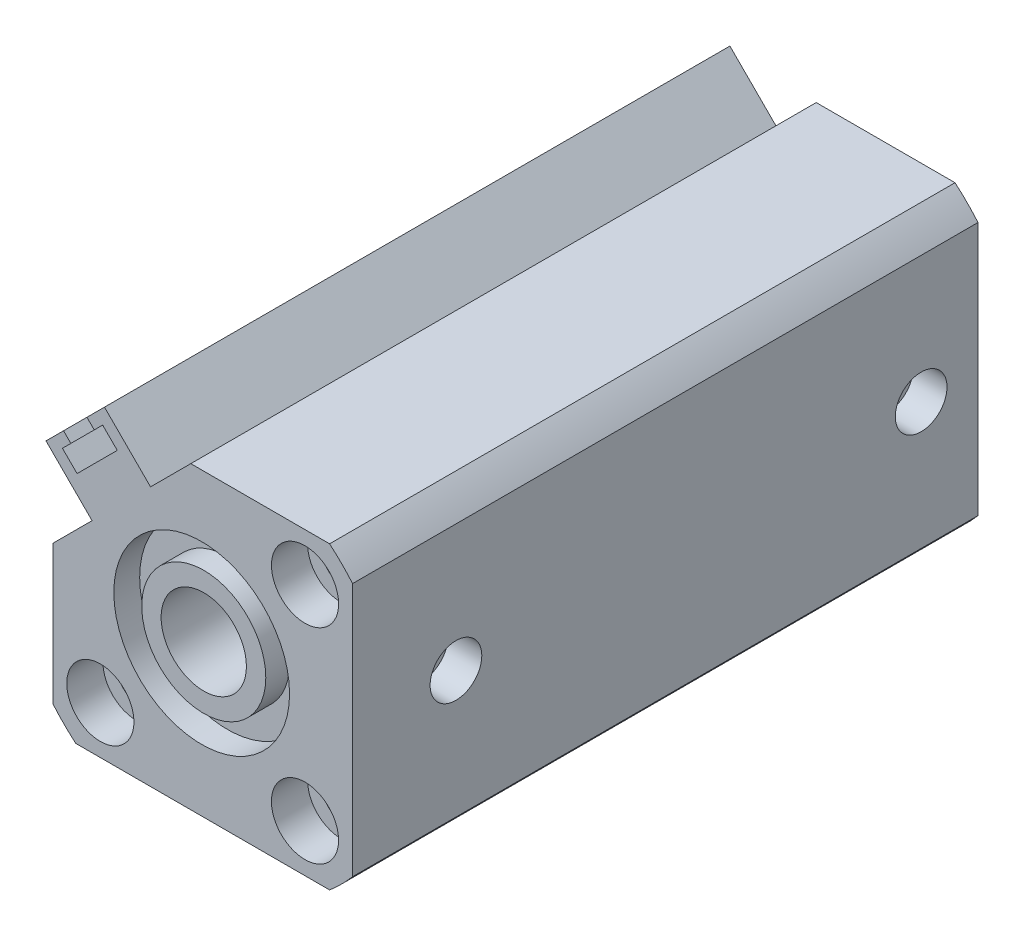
ISO-10303-21;
HEADER;
FILE_DESCRIPTION(('STEP AP214'),'2;1');
FILE_NAME('part.step','',(''),(''),'','','');
FILE_SCHEMA(('AUTOMOTIVE_DESIGN { 1 0 10303 214 1 1 1 1 }'));
ENDSEC;
DATA;
#1=APPLICATION_CONTEXT('core data for automotive mechanical design processes');
#2=APPLICATION_PROTOCOL_DEFINITION('international standard','automotive_design',2000,#1);
#3=PRODUCT_CONTEXT('',#1,'mechanical');
#4=PRODUCT('Part','Part','',(#3));
#5=PRODUCT_RELATED_PRODUCT_CATEGORY('part','',(#4));
#6=PRODUCT_DEFINITION_FORMATION('','',#4);
#7=PRODUCT_DEFINITION_CONTEXT('part definition',#1,'design');
#8=PRODUCT_DEFINITION('design','',#6,#7);
#9=PRODUCT_DEFINITION_SHAPE('','',#8);
#10=(LENGTH_UNIT() NAMED_UNIT(*) SI_UNIT(.MILLI.,.METRE.));
#11=(NAMED_UNIT(*) PLANE_ANGLE_UNIT() SI_UNIT($,.RADIAN.));
#12=(NAMED_UNIT(*) SI_UNIT($,.STERADIAN.) SOLID_ANGLE_UNIT());
#13=UNCERTAINTY_MEASURE_WITH_UNIT(LENGTH_MEASURE(1.E-05),#10,'distance_accuracy_value','');
#14=(GEOMETRIC_REPRESENTATION_CONTEXT(3) GLOBAL_UNCERTAINTY_ASSIGNED_CONTEXT((#13)) GLOBAL_UNIT_ASSIGNED_CONTEXT((#10,
#11,#12)) REPRESENTATION_CONTEXT('',''));
#15=CARTESIAN_POINT('',(0.,0.,0.));
#16=DIRECTION('',(0.,0.,1.));
#17=DIRECTION('',(1.,0.,0.));
#18=AXIS2_PLACEMENT_3D('',#15,#16,#17);
#19=CARTESIAN_POINT('',(-9.80416257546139,-9.89949493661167,27.75));
#20=DIRECTION('',(0.,0.,-1.));
#21=DIRECTION('',(-1.,0.,0.));
#22=AXIS2_PLACEMENT_3D('',#19,#20,#21);
#23=CYLINDRICAL_SURFACE('',#22,1.75);
#24=CARTESIAN_POINT('',(-9.80416257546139,-9.89949493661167,24.2499999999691));
#25=DIRECTION('',(0.,0.,1.));
#26=DIRECTION('',(1.,0.,0.));
#27=AXIS2_PLACEMENT_3D('',#24,#25,#26);
#28=CIRCLE('',#27,1.75);
#29=CARTESIAN_POINT('',(-8.05416257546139,-9.89949493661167,24.2499999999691));
#30=VERTEX_POINT('',#29);
#31=EDGE_CURVE('E180',#30,#30,#28,.T.);
#32=ORIENTED_EDGE('',*,*,#31,.T.);
#33=EDGE_LOOP('',(#32));
#34=FACE_BOUND('',#33,.T.);
#35=CARTESIAN_POINT('',(-9.80416257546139,-9.89949493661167,-24.25));
#36=DIRECTION('',(0.,0.,-1.));
#37=DIRECTION('',(-1.,0.,0.));
#38=AXIS2_PLACEMENT_3D('',#35,#36,#37);
#39=CIRCLE('',#38,1.75);
#40=CARTESIAN_POINT('',(-11.5541625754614,-9.89949493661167,-24.25));
#41=VERTEX_POINT('',#40);
#42=EDGE_CURVE('E34',#41,#41,#39,.T.);
#43=ORIENTED_EDGE('',*,*,#42,.T.);
#44=EDGE_LOOP('',(#43));
#45=FACE_BOUND('',#44,.T.);
#46=ADVANCED_FACE('F30',(#34,#45),#23,.F.);
#47=CARTESIAN_POINT('',(9.99482729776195,9.89949493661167,27.75));
#48=DIRECTION('',(0.,0.,-1.));
#49=DIRECTION('',(-1.,0.,0.));
#50=AXIS2_PLACEMENT_3D('',#47,#48,#49);
#51=CYLINDRICAL_SURFACE('',#50,1.75);
#52=CARTESIAN_POINT('',(9.99482729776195,9.89949493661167,24.2499999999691));
#53=DIRECTION('',(0.,0.,1.));
#54=DIRECTION('',(1.,0.,0.));
#55=AXIS2_PLACEMENT_3D('',#52,#53,#54);
#56=CIRCLE('',#55,1.75);
#57=CARTESIAN_POINT('',(11.7448272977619,9.89949493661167,24.2499999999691));
#58=VERTEX_POINT('',#57);
#59=EDGE_CURVE('E257',#58,#58,#56,.T.);
#60=ORIENTED_EDGE('',*,*,#59,.T.);
#61=EDGE_LOOP('',(#60));
#62=FACE_BOUND('',#61,.T.);
#63=CARTESIAN_POINT('',(9.99482729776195,9.89949493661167,-24.25));
#64=DIRECTION('',(0.,0.,-1.));
#65=DIRECTION('',(-1.,0.,0.));
#66=AXIS2_PLACEMENT_3D('',#63,#64,#65);
#67=CIRCLE('',#66,1.75);
#68=CARTESIAN_POINT('',(8.24482729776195,9.89949493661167,-24.25));
#69=VERTEX_POINT('',#68);
#70=EDGE_CURVE('E261',#69,#69,#67,.T.);
#71=ORIENTED_EDGE('',*,*,#70,.T.);
#72=EDGE_LOOP('',(#71));
#73=FACE_BOUND('',#72,.T.);
#74=ADVANCED_FACE('F307',(#62,#73),#51,.F.);
#75=CARTESIAN_POINT('',(-1.01925385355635,14.5370953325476,113.238371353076));
#76=DIRECTION('',(0.707106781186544,-0.707106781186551,0.));
#77=DIRECTION('',(0.707106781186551,0.707106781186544,0.));
#78=AXIS2_PLACEMENT_3D('',#75,#76,#77);
#79=PLANE('',#78);
#80=DIRECTION('',(0.,0.,-1.));
#81=VECTOR('',#80,1.);
#82=CARTESIAN_POINT('',(-4.94974746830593,10.6066017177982,27.75));
#83=LINE('',#82,#81);
#84=CARTESIAN_POINT('',(-4.94974746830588,10.6066017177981,27.75));
#85=VERTEX_POINT('',#84);
#86=CARTESIAN_POINT('',(-4.94974746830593,10.6066017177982,-32.75));
#87=VERTEX_POINT('',#86);
#88=EDGE_CURVE('E54',#85,#87,#83,.T.);
#89=ORIENTED_EDGE('',*,*,#88,.F.);
#90=DIRECTION('',(0.707106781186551,0.707106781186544,0.));
#91=VECTOR('',#90,1.);
#92=CARTESIAN_POINT('',(-7.73050841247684,7.8258407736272,27.75));
#93=LINE('',#92,#91);
#94=CARTESIAN_POINT('',(-1.05634918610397,14.5,27.75));
#95=VERTEX_POINT('',#94);
#96=EDGE_CURVE('E445',#85,#95,#93,.T.);
#97=ORIENTED_EDGE('',*,*,#96,.T.);
#98=DIRECTION('',(0.,0.,1.));
#99=VECTOR('',#98,1.);
#100=CARTESIAN_POINT('',(-1.05634918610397,14.5,27.75));
#101=LINE('',#100,#99);
#102=CARTESIAN_POINT('',(-1.05634918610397,14.5,-32.75));
#103=VERTEX_POINT('',#102);
#104=EDGE_CURVE('E446',#103,#95,#101,.T.);
#105=ORIENTED_EDGE('',*,*,#104,.F.);
#106=DIRECTION('',(0.707106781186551,0.707106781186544,0.));
#107=VECTOR('',#106,1.);
#108=CARTESIAN_POINT('',(-7.73050841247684,7.8258407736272,-32.75));
#109=LINE('',#108,#107);
#110=EDGE_CURVE('E39',#87,#103,#109,.T.);
#111=ORIENTED_EDGE('',*,*,#110,.F.);
#112=EDGE_LOOP('',(#89,#97,#105,#111));
#113=FACE_BOUND('',#112,.T.);
#114=ADVANCED_FACE('F314',(#113),#79,.F.);
#115=CARTESIAN_POINT('',(0.,0.,-17.5));
#116=DIRECTION('',(0.,0.,1.));
#117=DIRECTION('',(1.,0.,0.));
#118=AXIS2_PLACEMENT_3D('',#115,#116,#117);
#119=CYLINDRICAL_SURFACE('',#118,8.);
#120=CARTESIAN_POINT('',(0.,0.,-17.5));
#121=DIRECTION('',(0.,0.,1.));
#122=DIRECTION('',(1.,0.,0.));
#123=AXIS2_PLACEMENT_3D('',#120,#121,#122);
#124=CIRCLE('',#123,8.);
#125=CARTESIAN_POINT('',(8.,0.,-17.5));
#126=VERTEX_POINT('',#125);
#127=EDGE_CURVE('E476',#126,#126,#124,.T.);
#128=ORIENTED_EDGE('',*,*,#127,.F.);
#129=EDGE_LOOP('',(#128));
#130=FACE_BOUND('',#129,.T.);
#131=CARTESIAN_POINT('',(0.,0.,17.5));
#132=DIRECTION('',(0.,0.,1.));
#133=DIRECTION('',(1.,0.,0.));
#134=AXIS2_PLACEMENT_3D('',#131,#132,#133);
#135=CIRCLE('',#134,8.);
#136=CARTESIAN_POINT('',(8.,0.,17.5));
#137=VERTEX_POINT('',#136);
#138=EDGE_CURVE('E473',#137,#137,#135,.T.);
#139=ORIENTED_EDGE('',*,*,#138,.T.);
#140=EDGE_LOOP('',(#139));
#141=FACE_BOUND('',#140,.T.);
#142=ADVANCED_FACE('F505',(#130,#141),#119,.F.);
#143=CARTESIAN_POINT('',(0.,0.,-17.5));
#144=DIRECTION('',(0.,0.,1.));
#145=DIRECTION('',(1.,0.,0.));
#146=AXIS2_PLACEMENT_3D('',#143,#144,#145);
#147=PLANE('',#146);
#148=CARTESIAN_POINT('',(0.,0.,-17.5));
#149=DIRECTION('',(0.,0.,1.));
#150=DIRECTION('',(1.,0.,0.));
#151=AXIS2_PLACEMENT_3D('',#148,#149,#150);
#152=CIRCLE('',#151,4.125);
#153=CARTESIAN_POINT('',(4.125,0.,-17.5));
#154=VERTEX_POINT('',#153);
#155=EDGE_CURVE('E435',#154,#154,#152,.T.);
#156=ORIENTED_EDGE('',*,*,#155,.F.);
#157=EDGE_LOOP('',(#156));
#158=FACE_BOUND('',#157,.T.);
#159=ORIENTED_EDGE('',*,*,#127,.T.);
#160=EDGE_LOOP('',(#159));
#161=FACE_BOUND('',#160,.T.);
#162=ADVANCED_FACE('F507',(#158,#161),#147,.T.);
#163=CARTESIAN_POINT('',(0.,0.,17.5));
#164=DIRECTION('',(0.,0.,1.));
#165=DIRECTION('',(1.,0.,0.));
#166=AXIS2_PLACEMENT_3D('',#163,#164,#165);
#167=PLANE('',#166);
#168=CARTESIAN_POINT('',(0.,0.,17.5));
#169=DIRECTION('',(0.,0.,1.));
#170=DIRECTION('',(1.,0.,0.));
#171=AXIS2_PLACEMENT_3D('',#168,#169,#170);
#172=CIRCLE('',#171,4.125);
#173=CARTESIAN_POINT('',(4.125,0.,17.5));
#174=VERTEX_POINT('',#173);
#175=EDGE_CURVE('E432',#174,#174,#172,.T.);
#176=ORIENTED_EDGE('',*,*,#175,.T.);
#177=EDGE_LOOP('',(#176));
#178=FACE_BOUND('',#177,.T.);
#179=ORIENTED_EDGE('',*,*,#138,.F.);
#180=EDGE_LOOP('',(#179));
#181=FACE_BOUND('',#180,.T.);
#182=ADVANCED_FACE('F511',(#178,#181),#167,.F.);
#183=CARTESIAN_POINT('',(0.,0.,-27.5));
#184=DIRECTION('',(0.,0.,1.));
#185=DIRECTION('',(1.,0.,0.));
#186=AXIS2_PLACEMENT_3D('',#183,#184,#185);
#187=CYLINDRICAL_SURFACE('',#186,4.125);
#188=CARTESIAN_POINT('',(0.,0.,27.5499999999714));
#189=DIRECTION('',(0.,0.,1.));
#190=DIRECTION('',(1.,0.,0.));
#191=AXIS2_PLACEMENT_3D('',#188,#189,#190);
#192=CIRCLE('',#191,4.125);
#193=CARTESIAN_POINT('',(4.125,0.,27.5499999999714));
#194=VERTEX_POINT('',#193);
#195=EDGE_CURVE('E464',#194,#194,#192,.T.);
#196=ORIENTED_EDGE('',*,*,#195,.T.);
#197=EDGE_LOOP('',(#196));
#198=FACE_BOUND('',#197,.T.);
#199=ORIENTED_EDGE('',*,*,#175,.F.);
#200=EDGE_LOOP('',(#199));
#201=FACE_BOUND('',#200,.T.);
#202=ADVANCED_FACE('F514',(#198,#201),#187,.F.);
#203=ORIENTED_EDGE('',*,*,#155,.T.);
#204=EDGE_LOOP('',(#203));
#205=FACE_BOUND('',#204,.T.);
#206=CARTESIAN_POINT('',(0.,0.,-27.5));
#207=DIRECTION('',(0.,0.,1.));
#208=DIRECTION('',(1.,0.,0.));
#209=AXIS2_PLACEMENT_3D('',#206,#207,#208);
#210=CIRCLE('',#209,4.125);
#211=CARTESIAN_POINT('',(4.125,0.,-27.5));
#212=VERTEX_POINT('',#211);
#213=EDGE_CURVE('E436',#212,#212,#210,.T.);
#214=ORIENTED_EDGE('',*,*,#213,.F.);
#215=EDGE_LOOP('',(#214));
#216=FACE_BOUND('',#215,.T.);
#217=ADVANCED_FACE('F520',(#205,#216),#187,.F.);
#218=CARTESIAN_POINT('',(0.,0.,-27.5));
#219=DIRECTION('',(0.,0.,1.));
#220=DIRECTION('',(1.,0.,0.));
#221=AXIS2_PLACEMENT_3D('',#218,#219,#220);
#222=PLANE('',#221);
#223=ORIENTED_EDGE('',*,*,#213,.T.);
#224=EDGE_LOOP('',(#223));
#225=FACE_BOUND('',#224,.T.);
#226=ADVANCED_FACE('F504',(#225),#222,.T.);
#227=CARTESIAN_POINT('',(0.,0.,25.2499999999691));
#228=DIRECTION('',(0.,0.,1.));
#229=DIRECTION('',(1.,0.,0.));
#230=AXIS2_PLACEMENT_3D('',#227,#228,#229);
#231=PLANE('',#230);
#232=CARTESIAN_POINT('',(0.,0.,25.2499999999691));
#233=DIRECTION('',(0.,0.,1.));
#234=DIRECTION('',(1.,0.,0.));
#235=AXIS2_PLACEMENT_3D('',#232,#233,#234);
#236=CIRCLE('',#235,8.5);
#237=CARTESIAN_POINT('',(8.5,0.,25.2499999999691));
#238=VERTEX_POINT('',#237);
#239=EDGE_CURVE('E394',#238,#238,#236,.T.);
#240=ORIENTED_EDGE('',*,*,#239,.T.);
#241=EDGE_LOOP('',(#240));
#242=FACE_BOUND('',#241,.T.);
#243=CARTESIAN_POINT('',(0.,0.,25.2499999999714));
#244=DIRECTION('',(0.,0.,1.));
#245=DIRECTION('',(1.,0.,0.));
#246=AXIS2_PLACEMENT_3D('',#243,#244,#245);
#247=CIRCLE('',#246,6.);
#248=CARTESIAN_POINT('',(6.,0.,25.2499999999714));
#249=VERTEX_POINT('',#248);
#250=EDGE_CURVE('E467',#249,#249,#247,.T.);
#251=ORIENTED_EDGE('',*,*,#250,.F.);
#252=EDGE_LOOP('',(#251));
#253=FACE_BOUND('',#252,.T.);
#254=ADVANCED_FACE('F329',(#242,#253),#231,.T.);
#255=CARTESIAN_POINT('',(0.0953323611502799,0.,27.75));
#256=DIRECTION('',(0.,0.,1.));
#257=DIRECTION('',(1.,0.,0.));
#258=AXIS2_PLACEMENT_3D('',#255,#256,#257);
#259=PLANE('',#258);
#260=CARTESIAN_POINT('',(9.99482729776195,9.89949493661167,27.7499999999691));
#261=DIRECTION('',(0.,0.,1.));
#262=DIRECTION('',(1.,0.,0.));
#263=AXIS2_PLACEMENT_3D('',#260,#261,#262);
#264=CIRCLE('',#263,3.25);
#265=CARTESIAN_POINT('',(13.2448272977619,9.89949493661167,27.7499999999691));
#266=VERTEX_POINT('',#265);
#267=EDGE_CURVE('E281',#266,#266,#264,.T.);
#268=ORIENTED_EDGE('',*,*,#267,.F.);
#269=EDGE_LOOP('',(#268));
#270=FACE_BOUND('',#269,.T.);
#271=CARTESIAN_POINT('',(9.99482729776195,-9.89949493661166,27.7499999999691));
#272=DIRECTION('',(0.,0.,1.));
#273=DIRECTION('',(-1.,0.,0.));
#274=AXIS2_PLACEMENT_3D('',#271,#272,#273);
#275=CIRCLE('',#274,3.25);
#276=CARTESIAN_POINT('',(6.74482729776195,-9.89949493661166,27.7499999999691));
#277=VERTEX_POINT('',#276);
#278=EDGE_CURVE('E259',#277,#277,#275,.T.);
#279=ORIENTED_EDGE('',*,*,#278,.F.);
#280=EDGE_LOOP('',(#279));
#281=FACE_BOUND('',#280,.T.);
#282=CARTESIAN_POINT('',(-9.80416257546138,-9.89949493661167,27.7499999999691));
#283=DIRECTION('',(0.,0.,1.));
#284=DIRECTION('',(1.,0.,0.));
#285=AXIS2_PLACEMENT_3D('',#282,#283,#284);
#286=CIRCLE('',#285,3.25);
#287=CARTESIAN_POINT('',(-6.55416257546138,-9.89949493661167,27.7499999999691));
#288=VERTEX_POINT('',#287);
#289=EDGE_CURVE('E255',#288,#288,#286,.T.);
#290=ORIENTED_EDGE('',*,*,#289,.F.);
#291=EDGE_LOOP('',(#290));
#292=FACE_BOUND('',#291,.T.);
#293=CARTESIAN_POINT('',(-14.4046676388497,1.1516815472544,27.75));
#294=VERTEX_POINT('',#293);
#295=CARTESIAN_POINT('',(-10.6066017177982,4.94974746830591,27.75));
#296=VERTEX_POINT('',#295);
#297=EDGE_CURVE('E439',#294,#296,#93,.T.);
#298=ORIENTED_EDGE('',*,*,#297,.F.);
#299=DIRECTION('',(0.,-1.,0.));
#300=VECTOR('',#299,1.);
#301=CARTESIAN_POINT('',(-14.4046676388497,12.2780291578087,27.75));
#302=LINE('',#301,#300);
#303=CARTESIAN_POINT('',(-14.4046676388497,-12.2780291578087,27.75));
#304=VERTEX_POINT('',#303);
#305=EDGE_CURVE('E417',#294,#304,#302,.T.);
#306=ORIENTED_EDGE('',*,*,#305,.T.);
#307=CARTESIAN_POINT('',(0.0953323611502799,0.,27.75));
#308=DIRECTION('',(0.,0.,1.));
#309=DIRECTION('',(1.,0.,0.));
#310=AXIS2_PLACEMENT_3D('',#307,#308,#309);
#311=CIRCLE('',#310,19.);
#312=CARTESIAN_POINT('',(-12.1826967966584,-14.5,27.75));
#313=VERTEX_POINT('',#312);
#314=EDGE_CURVE('E419',#304,#313,#311,.T.);
#315=ORIENTED_EDGE('',*,*,#314,.T.);
#316=DIRECTION('',(1.,0.,0.));
#317=VECTOR('',#316,1.);
#318=CARTESIAN_POINT('',(-12.1826967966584,-14.5,27.75));
#319=LINE('',#318,#317);
#320=CARTESIAN_POINT('',(12.373361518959,-14.5,27.75));
#321=VERTEX_POINT('',#320);
#322=EDGE_CURVE('E421',#313,#321,#319,.T.);
#323=ORIENTED_EDGE('',*,*,#322,.T.);
#324=CARTESIAN_POINT('',(0.0953323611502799,0.,27.75));
#325=DIRECTION('',(0.,0.,1.));
#326=DIRECTION('',(1.,0.,0.));
#327=AXIS2_PLACEMENT_3D('',#324,#325,#326);
#328=CIRCLE('',#327,19.);
#329=CARTESIAN_POINT('',(14.5953323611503,-12.2780291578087,27.75));
#330=VERTEX_POINT('',#329);
#331=EDGE_CURVE('E409',#321,#330,#328,.T.);
#332=ORIENTED_EDGE('',*,*,#331,.T.);
#333=DIRECTION('',(0.,1.,0.));
#334=VECTOR('',#333,1.);
#335=CARTESIAN_POINT('',(14.5953323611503,12.2780291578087,27.75));
#336=LINE('',#335,#334);
#337=CARTESIAN_POINT('',(14.5953323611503,12.2780291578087,27.75));
#338=VERTEX_POINT('',#337);
#339=EDGE_CURVE('E372',#330,#338,#336,.T.);
#340=ORIENTED_EDGE('',*,*,#339,.T.);
#341=CARTESIAN_POINT('',(0.0953323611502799,0.,27.75));
#342=DIRECTION('',(0.,0.,1.));
#343=DIRECTION('',(1.,0.,0.));
#344=AXIS2_PLACEMENT_3D('',#341,#342,#343);
#345=CIRCLE('',#344,19.);
#346=CARTESIAN_POINT('',(12.3733615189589,14.5,27.75));
#347=VERTEX_POINT('',#346);
#348=EDGE_CURVE('E412',#338,#347,#345,.T.);
#349=ORIENTED_EDGE('',*,*,#348,.T.);
#350=DIRECTION('',(-1.,0.,0.));
#351=VECTOR('',#350,1.);
#352=CARTESIAN_POINT('',(-12.1826967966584,14.5,27.75));
#353=LINE('',#352,#351);
#354=EDGE_CURVE('E414',#347,#95,#353,.T.);
#355=ORIENTED_EDGE('',*,*,#354,.T.);
#356=ORIENTED_EDGE('',*,*,#96,.F.);
#357=DIRECTION('',(-0.707106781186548,0.707106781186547,0.));
#358=VECTOR('',#357,1.);
#359=CARTESIAN_POINT('',(-4.94974746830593,10.6066017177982,27.75));
#360=LINE('',#359,#358);
#361=CARTESIAN_POINT('',(-9.40452018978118,15.0613744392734,27.75));
#362=VERTEX_POINT('',#361);
#363=EDGE_CURVE('E222',#85,#362,#360,.T.);
#364=ORIENTED_EDGE('',*,*,#363,.T.);
#365=DIRECTION('',(-0.707106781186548,-0.707106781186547,0.));
#366=VECTOR('',#365,1.);
#367=CARTESIAN_POINT('',(-11.1015764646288,13.3643181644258,27.75));
#368=LINE('',#367,#366);
#369=CARTESIAN_POINT('',(-11.1015764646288,13.3643181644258,27.75));
#370=VERTEX_POINT('',#369);
#371=EDGE_CURVE('E219',#362,#370,#368,.T.);
#372=ORIENTED_EDGE('',*,*,#371,.T.);
#373=DIRECTION('',(0.707106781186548,-0.707106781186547,0.));
#374=VECTOR('',#373,1.);
#375=CARTESIAN_POINT('',(-10.3944696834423,12.6572113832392,27.75));
#376=LINE('',#375,#374);
#377=CARTESIAN_POINT('',(-10.3944696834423,12.6572113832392,27.75));
#378=VERTEX_POINT('',#377);
#379=EDGE_CURVE('E221',#370,#378,#376,.T.);
#380=ORIENTED_EDGE('',*,*,#379,.T.);
#381=DIRECTION('',(0.707106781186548,0.707106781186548,0.));
#382=VECTOR('',#381,1.);
#383=CARTESIAN_POINT('',(-10.3944696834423,12.6572113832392,27.75));
#384=LINE('',#383,#382);
#385=CARTESIAN_POINT('',(-9.58129688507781,13.4703841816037,27.75));
#386=VERTEX_POINT('',#385);
#387=EDGE_CURVE('E224',#378,#386,#384,.T.);
#388=ORIENTED_EDGE('',*,*,#387,.T.);
#389=DIRECTION('',(0.707106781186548,-0.707106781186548,0.));
#390=VECTOR('',#389,1.);
#391=CARTESIAN_POINT('',(-8.16708332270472,12.0561706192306,27.75));
#392=LINE('',#391,#390);
#393=CARTESIAN_POINT('',(-8.16708332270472,12.0561706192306,27.75));
#394=VERTEX_POINT('',#393);
#395=EDGE_CURVE('E226',#386,#394,#392,.T.);
#396=ORIENTED_EDGE('',*,*,#395,.T.);
#397=DIRECTION('',(-0.707106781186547,-0.707106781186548,0.));
#398=VECTOR('',#397,1.);
#399=CARTESIAN_POINT('',(-12.0561706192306,8.16708332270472,27.75));
#400=LINE('',#399,#398);
#401=CARTESIAN_POINT('',(-12.0561706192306,8.16708332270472,27.75));
#402=VERTEX_POINT('',#401);
#403=EDGE_CURVE('E228',#394,#402,#400,.T.);
#404=ORIENTED_EDGE('',*,*,#403,.T.);
#405=DIRECTION('',(-0.707106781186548,0.707106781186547,0.));
#406=VECTOR('',#405,1.);
#407=CARTESIAN_POINT('',(-12.0561706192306,8.16708332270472,27.75));
#408=LINE('',#407,#406);
#409=CARTESIAN_POINT('',(-13.4703841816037,9.58129688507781,27.75));
#410=VERTEX_POINT('',#409);
#411=EDGE_CURVE('E230',#402,#410,#408,.T.);
#412=ORIENTED_EDGE('',*,*,#411,.T.);
#413=DIRECTION('',(0.707106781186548,0.707106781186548,0.));
#414=VECTOR('',#413,1.);
#415=CARTESIAN_POINT('',(-13.4703841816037,9.58129688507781,27.75));
#416=LINE('',#415,#414);
#417=CARTESIAN_POINT('',(-12.6572113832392,10.3944696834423,27.75));
#418=VERTEX_POINT('',#417);
#419=EDGE_CURVE('E232',#410,#418,#416,.T.);
#420=ORIENTED_EDGE('',*,*,#419,.T.);
#421=DIRECTION('',(-0.707106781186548,0.707106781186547,0.));
#422=VECTOR('',#421,1.);
#423=CARTESIAN_POINT('',(-12.6572113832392,10.3944696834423,27.75));
#424=LINE('',#423,#422);
#425=CARTESIAN_POINT('',(-13.3643181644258,11.1015764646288,27.75));
#426=VERTEX_POINT('',#425);
#427=EDGE_CURVE('E234',#418,#426,#424,.T.);
#428=ORIENTED_EDGE('',*,*,#427,.T.);
#429=DIRECTION('',(-0.707106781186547,-0.707106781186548,0.));
#430=VECTOR('',#429,1.);
#431=CARTESIAN_POINT('',(-15.0613744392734,9.40452018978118,27.75));
#432=LINE('',#431,#430);
#433=CARTESIAN_POINT('',(-15.0613744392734,9.40452018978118,27.75));
#434=VERTEX_POINT('',#433);
#435=EDGE_CURVE('E236',#426,#434,#432,.T.);
#436=ORIENTED_EDGE('',*,*,#435,.T.);
#437=DIRECTION('',(0.707106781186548,-0.707106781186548,0.));
#438=VECTOR('',#437,1.);
#439=CARTESIAN_POINT('',(-10.6066017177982,4.94974746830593,27.75));
#440=LINE('',#439,#438);
#441=EDGE_CURVE('E238',#434,#296,#440,.T.);
#442=ORIENTED_EDGE('',*,*,#441,.T.);
#443=EDGE_LOOP('',(#298,#306,#315,#323,#332,#340,#349,#355,#356,#364,#372,#380,#388,#396,#404,
#412,#420,#428,#436,#442));
#444=FACE_BOUND('',#443,.T.);
#445=CARTESIAN_POINT('',(0.,0.,27.7499999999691));
#446=DIRECTION('',(0.,0.,1.));
#447=DIRECTION('',(1.,0.,0.));
#448=AXIS2_PLACEMENT_3D('',#445,#446,#447);
#449=CIRCLE('',#448,8.5);
#450=CARTESIAN_POINT('',(8.5,0.,27.7499999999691));
#451=VERTEX_POINT('',#450);
#452=EDGE_CURVE('E479',#451,#451,#449,.T.);
#453=ORIENTED_EDGE('',*,*,#452,.F.);
#454=EDGE_LOOP('',(#453));
#455=FACE_BOUND('',#454,.T.);
#456=ADVANCED_FACE('F326',(#270,#281,#292,#444,#455),#259,.T.);
#457=CARTESIAN_POINT('',(0.0953323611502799,0.,27.75));
#458=DIRECTION('',(0.,0.,-1.));
#459=DIRECTION('',(-1.,0.,0.));
#460=AXIS2_PLACEMENT_3D('',#457,#458,#459);
#461=CYLINDRICAL_SURFACE('',#460,19.);
#462=DIRECTION('',(0.,0.,-1.));
#463=VECTOR('',#462,1.);
#464=CARTESIAN_POINT('',(12.373361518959,-14.5,27.75));
#465=LINE('',#464,#463);
#466=CARTESIAN_POINT('',(12.373361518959,-14.5,-32.75));
#467=VERTEX_POINT('',#466);
#468=EDGE_CURVE('E390',#321,#467,#465,.T.);
#469=ORIENTED_EDGE('',*,*,#468,.T.);
#470=CARTESIAN_POINT('',(0.0953323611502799,0.,-32.75));
#471=DIRECTION('',(0.,0.,1.));
#472=DIRECTION('',(1.,0.,0.));
#473=AXIS2_PLACEMENT_3D('',#470,#471,#472);
#474=CIRCLE('',#473,19.);
#475=CARTESIAN_POINT('',(14.5953323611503,-12.2780291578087,-32.75));
#476=VERTEX_POINT('',#475);
#477=EDGE_CURVE('E383',#467,#476,#474,.T.);
#478=ORIENTED_EDGE('',*,*,#477,.T.);
#479=DIRECTION('',(0.,0.,-1.));
#480=VECTOR('',#479,1.);
#481=CARTESIAN_POINT('',(14.5953323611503,-12.2780291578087,27.75));
#482=LINE('',#481,#480);
#483=EDGE_CURVE('E368',#330,#476,#482,.T.);
#484=ORIENTED_EDGE('',*,*,#483,.F.);
#485=ORIENTED_EDGE('',*,*,#331,.F.);
#486=EDGE_LOOP('',(#469,#478,#484,#485));
#487=FACE_BOUND('',#486,.T.);
#488=ADVANCED_FACE('F32',(#487),#461,.T.);
#489=CARTESIAN_POINT('',(14.5953323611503,12.2780291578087,27.75));
#490=DIRECTION('',(-1.,0.,0.));
#491=DIRECTION('',(0.,0.,1.));
#492=AXIS2_PLACEMENT_3D('',#489,#490,#491);
#493=PLANE('',#492);
#494=CARTESIAN_POINT('',(14.5953323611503,0.,17.75));
#495=DIRECTION('',(1.,0.,0.));
#496=DIRECTION('',(0.,0.,-1.));
#497=AXIS2_PLACEMENT_3D('',#494,#495,#496);
#498=CIRCLE('',#497,2.5);
#499=CARTESIAN_POINT('',(14.5953323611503,0.,15.25));
#500=VERTEX_POINT('',#499);
#501=EDGE_CURVE('E361',#500,#500,#498,.T.);
#502=ORIENTED_EDGE('',*,*,#501,.F.);
#503=EDGE_LOOP('',(#502));
#504=FACE_BOUND('',#503,.T.);
#505=CARTESIAN_POINT('',(14.5953323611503,0.,-27.25));
#506=DIRECTION('',(1.,0.,0.));
#507=DIRECTION('',(0.,0.,-1.));
#508=AXIS2_PLACEMENT_3D('',#505,#506,#507);
#509=CIRCLE('',#508,2.5);
#510=CARTESIAN_POINT('',(14.5953323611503,0.,-29.75));
#511=VERTEX_POINT('',#510);
#512=EDGE_CURVE('E365',#511,#511,#509,.T.);
#513=ORIENTED_EDGE('',*,*,#512,.F.);
#514=EDGE_LOOP('',(#513));
#515=FACE_BOUND('',#514,.T.);
#516=ORIENTED_EDGE('',*,*,#483,.T.);
#517=DIRECTION('',(0.,1.,0.));
#518=VECTOR('',#517,1.);
#519=CARTESIAN_POINT('',(14.5953323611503,12.2780291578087,-32.75));
#520=LINE('',#519,#518);
#521=CARTESIAN_POINT('',(14.5953323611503,12.2780291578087,-32.75));
#522=VERTEX_POINT('',#521);
#523=EDGE_CURVE('E371',#476,#522,#520,.T.);
#524=ORIENTED_EDGE('',*,*,#523,.T.);
#525=DIRECTION('',(0.,0.,-1.));
#526=VECTOR('',#525,1.);
#527=CARTESIAN_POINT('',(14.5953323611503,12.2780291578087,27.75));
#528=LINE('',#527,#526);
#529=EDGE_CURVE('E376',#338,#522,#528,.T.);
#530=ORIENTED_EDGE('',*,*,#529,.F.);
#531=ORIENTED_EDGE('',*,*,#339,.F.);
#532=EDGE_LOOP('',(#516,#524,#530,#531));
#533=FACE_BOUND('',#532,.T.);
#534=ADVANCED_FACE('F348',(#504,#515,#533),#493,.F.);
#535=CARTESIAN_POINT('',(0.0953323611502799,0.,27.75));
#536=DIRECTION('',(0.,0.,-1.));
#537=DIRECTION('',(-1.,0.,0.));
#538=AXIS2_PLACEMENT_3D('',#535,#536,#537);
#539=CYLINDRICAL_SURFACE('',#538,19.);
#540=ORIENTED_EDGE('',*,*,#529,.T.);
#541=CARTESIAN_POINT('',(0.0953323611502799,0.,-32.75));
#542=DIRECTION('',(0.,0.,1.));
#543=DIRECTION('',(1.,0.,0.));
#544=AXIS2_PLACEMENT_3D('',#541,#542,#543);
#545=CIRCLE('',#544,19.);
#546=CARTESIAN_POINT('',(12.3733615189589,14.5,-32.75));
#547=VERTEX_POINT('',#546);
#548=EDGE_CURVE('E387',#522,#547,#545,.T.);
#549=ORIENTED_EDGE('',*,*,#548,.T.);
#550=DIRECTION('',(0.,0.,-1.));
#551=VECTOR('',#550,1.);
#552=CARTESIAN_POINT('',(12.3733615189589,14.5,27.75));
#553=LINE('',#552,#551);
#554=EDGE_CURVE('E429',#347,#547,#553,.T.);
#555=ORIENTED_EDGE('',*,*,#554,.F.);
#556=ORIENTED_EDGE('',*,*,#348,.F.);
#557=EDGE_LOOP('',(#540,#549,#555,#556));
#558=FACE_BOUND('',#557,.T.);
#559=ADVANCED_FACE('F345',(#558),#539,.T.);
#560=CARTESIAN_POINT('',(-12.1826967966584,14.5,27.75));
#561=DIRECTION('',(0.,-1.,0.));
#562=DIRECTION('',(0.,0.,-1.));
#563=AXIS2_PLACEMENT_3D('',#560,#561,#562);
#564=PLANE('',#563);
#565=DIRECTION('',(-1.,0.,0.));
#566=VECTOR('',#565,1.);
#567=CARTESIAN_POINT('',(-12.1826967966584,14.5,-32.75));
#568=LINE('',#567,#566);
#569=EDGE_CURVE('E399',#547,#103,#568,.T.);
#570=ORIENTED_EDGE('',*,*,#569,.T.);
#571=ORIENTED_EDGE('',*,*,#104,.T.);
#572=ORIENTED_EDGE('',*,*,#354,.F.);
#573=ORIENTED_EDGE('',*,*,#554,.T.);
#574=EDGE_LOOP('',(#570,#571,#572,#573));
#575=FACE_BOUND('',#574,.T.);
#576=ADVANCED_FACE('F341',(#575),#564,.F.);
#577=CARTESIAN_POINT('',(-14.4046676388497,12.2780291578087,27.75));
#578=DIRECTION('',(1.,0.,0.));
#579=DIRECTION('',(0.,0.,-1.));
#580=AXIS2_PLACEMENT_3D('',#577,#578,#579);
#581=PLANE('',#580);
#582=ORIENTED_EDGE('',*,*,#305,.F.);
#583=DIRECTION('',(0.,0.,-1.));
#584=VECTOR('',#583,1.);
#585=CARTESIAN_POINT('',(-14.4046676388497,1.1516815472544,27.75));
#586=LINE('',#585,#584);
#587=CARTESIAN_POINT('',(-14.4046676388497,1.1516815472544,-32.75));
#588=VERTEX_POINT('',#587);
#589=EDGE_CURVE('E619',#294,#588,#586,.T.);
#590=ORIENTED_EDGE('',*,*,#589,.T.);
#591=DIRECTION('',(0.,-1.,0.));
#592=VECTOR('',#591,1.);
#593=CARTESIAN_POINT('',(-14.4046676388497,12.2780291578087,-32.75));
#594=LINE('',#593,#592);
#595=CARTESIAN_POINT('',(-14.4046676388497,-12.2780291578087,-32.75));
#596=VERTEX_POINT('',#595);
#597=EDGE_CURVE('E402',#588,#596,#594,.T.);
#598=ORIENTED_EDGE('',*,*,#597,.T.);
#599=DIRECTION('',(0.,0.,-1.));
#600=VECTOR('',#599,1.);
#601=CARTESIAN_POINT('',(-14.4046676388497,-12.2780291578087,27.75));
#602=LINE('',#601,#600);
#603=EDGE_CURVE('E426',#304,#596,#602,.T.);
#604=ORIENTED_EDGE('',*,*,#603,.F.);
#605=EDGE_LOOP('',(#582,#590,#598,#604));
#606=FACE_BOUND('',#605,.T.);
#607=ADVANCED_FACE('F337',(#606),#581,.F.);
#608=CARTESIAN_POINT('',(0.0953323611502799,0.,27.75));
#609=DIRECTION('',(0.,0.,-1.));
#610=DIRECTION('',(-1.,0.,0.));
#611=AXIS2_PLACEMENT_3D('',#608,#609,#610);
#612=CYLINDRICAL_SURFACE('',#611,19.);
#613=ORIENTED_EDGE('',*,*,#603,.T.);
#614=CARTESIAN_POINT('',(0.0953323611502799,0.,-32.75));
#615=DIRECTION('',(0.,0.,1.));
#616=DIRECTION('',(1.,0.,0.));
#617=AXIS2_PLACEMENT_3D('',#614,#615,#616);
#618=CIRCLE('',#617,19.);
#619=CARTESIAN_POINT('',(-12.1826967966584,-14.5,-32.75));
#620=VERTEX_POINT('',#619);
#621=EDGE_CURVE('E404',#596,#620,#618,.T.);
#622=ORIENTED_EDGE('',*,*,#621,.T.);
#623=DIRECTION('',(0.,0.,-1.));
#624=VECTOR('',#623,1.);
#625=CARTESIAN_POINT('',(-12.1826967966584,-14.5,27.75));
#626=LINE('',#625,#624);
#627=EDGE_CURVE('E424',#313,#620,#626,.T.);
#628=ORIENTED_EDGE('',*,*,#627,.F.);
#629=ORIENTED_EDGE('',*,*,#314,.F.);
#630=EDGE_LOOP('',(#613,#622,#628,#629));
#631=FACE_BOUND('',#630,.T.);
#632=ADVANCED_FACE('F333',(#631),#612,.T.);
#633=CARTESIAN_POINT('',(-12.1826967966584,-14.5,27.75));
#634=DIRECTION('',(0.,1.,0.));
#635=DIRECTION('',(0.,0.,1.));
#636=AXIS2_PLACEMENT_3D('',#633,#634,#635);
#637=PLANE('',#636);
#638=ORIENTED_EDGE('',*,*,#627,.T.);
#639=DIRECTION('',(1.,0.,0.));
#640=VECTOR('',#639,1.);
#641=CARTESIAN_POINT('',(-12.1826967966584,-14.5,-32.75));
#642=LINE('',#641,#640);
#643=EDGE_CURVE('E407',#620,#467,#642,.T.);
#644=ORIENTED_EDGE('',*,*,#643,.T.);
#645=ORIENTED_EDGE('',*,*,#468,.F.);
#646=ORIENTED_EDGE('',*,*,#322,.F.);
#647=EDGE_LOOP('',(#638,#644,#645,#646));
#648=FACE_BOUND('',#647,.T.);
#649=ADVANCED_FACE('F323',(#648),#637,.F.);
#650=CARTESIAN_POINT('',(9.99482729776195,-9.89949493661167,27.75));
#651=DIRECTION('',(0.,0.,-1.));
#652=DIRECTION('',(-1.,0.,0.));
#653=AXIS2_PLACEMENT_3D('',#650,#651,#652);
#654=CYLINDRICAL_SURFACE('',#653,1.75);
#655=CARTESIAN_POINT('',(9.99482729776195,-9.89949493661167,24.2499999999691));
#656=DIRECTION('',(0.,0.,-1.));
#657=DIRECTION('',(-1.,0.,0.));
#658=AXIS2_PLACEMENT_3D('',#655,#656,#657);
#659=CIRCLE('',#658,1.75);
#660=CARTESIAN_POINT('',(8.24482729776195,-9.89949493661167,24.2499999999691));
#661=VERTEX_POINT('',#660);
#662=EDGE_CURVE('E252',#661,#661,#659,.T.);
#663=ORIENTED_EDGE('',*,*,#662,.F.);
#664=EDGE_LOOP('',(#663));
#665=FACE_BOUND('',#664,.T.);
#666=CARTESIAN_POINT('',(9.99482729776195,-9.89949493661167,-32.75));
#667=DIRECTION('',(0.,0.,1.));
#668=DIRECTION('',(-1.,0.,0.));
#669=AXIS2_PLACEMENT_3D('',#666,#667,#668);
#670=CIRCLE('',#669,1.75);
#671=CARTESIAN_POINT('',(8.24482729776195,-9.89949493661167,-32.75));
#672=VERTEX_POINT('',#671);
#673=EDGE_CURVE('E391',#672,#672,#670,.T.);
#674=ORIENTED_EDGE('',*,*,#673,.F.);
#675=EDGE_LOOP('',(#674));
#676=FACE_BOUND('',#675,.T.);
#677=ADVANCED_FACE('F322',(#665,#676),#654,.F.);
#678=CARTESIAN_POINT('',(0.0953323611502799,0.,-32.75));
#679=DIRECTION('',(0.,0.,1.));
#680=DIRECTION('',(1.,0.,0.));
#681=AXIS2_PLACEMENT_3D('',#678,#679,#680);
#682=PLANE('',#681);
#683=CARTESIAN_POINT('',(-9.80416257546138,-9.89949493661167,-32.75));
#684=DIRECTION('',(0.,0.,-1.));
#685=DIRECTION('',(-1.,0.,0.));
#686=AXIS2_PLACEMENT_3D('',#683,#684,#685);
#687=CIRCLE('',#686,3.25);
#688=CARTESIAN_POINT('',(-13.0541625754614,-9.89949493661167,-32.75));
#689=VERTEX_POINT('',#688);
#690=EDGE_CURVE('E825',#689,#689,#687,.T.);
#691=ORIENTED_EDGE('',*,*,#690,.F.);
#692=EDGE_LOOP('',(#691));
#693=FACE_BOUND('',#692,.T.);
#694=CARTESIAN_POINT('',(9.99482729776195,9.89949493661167,-32.75));
#695=DIRECTION('',(0.,0.,-1.));
#696=DIRECTION('',(-1.,0.,0.));
#697=AXIS2_PLACEMENT_3D('',#694,#695,#696);
#698=CIRCLE('',#697,3.25);
#699=CARTESIAN_POINT('',(6.74482729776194,9.89949493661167,-32.75));
#700=VERTEX_POINT('',#699);
#701=EDGE_CURVE('E271',#700,#700,#698,.T.);
#702=ORIENTED_EDGE('',*,*,#701,.F.);
#703=EDGE_LOOP('',(#702));
#704=FACE_BOUND('',#703,.T.);
#705=CARTESIAN_POINT('',(0.,0.,-32.7500000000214));
#706=DIRECTION('',(0.,0.,-1.));
#707=DIRECTION('',(-1.,0.,0.));
#708=AXIS2_PLACEMENT_3D('',#705,#706,#707);
#709=CIRCLE('',#708,9.5);
#710=CARTESIAN_POINT('',(-9.5,0.,-32.7500000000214));
#711=VERTEX_POINT('',#710);
#712=EDGE_CURVE('E263',#711,#711,#709,.T.);
#713=ORIENTED_EDGE('',*,*,#712,.F.);
#714=EDGE_LOOP('',(#713));
#715=FACE_BOUND('',#714,.T.);
#716=ORIENTED_EDGE('',*,*,#673,.T.);
#717=EDGE_LOOP('',(#716));
#718=FACE_BOUND('',#717,.T.);
#719=ORIENTED_EDGE('',*,*,#597,.F.);
#720=CARTESIAN_POINT('',(-10.6066017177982,4.94974746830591,-32.75));
#721=VERTEX_POINT('',#720);
#722=EDGE_CURVE('E11',#588,#721,#109,.T.);
#723=ORIENTED_EDGE('',*,*,#722,.T.);
#724=DIRECTION('',(0.707106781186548,-0.707106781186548,0.));
#725=VECTOR('',#724,1.);
#726=CARTESIAN_POINT('',(-10.6066017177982,4.94974746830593,-32.75));
#727=LINE('',#726,#725);
#728=CARTESIAN_POINT('',(-15.0613744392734,9.40452018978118,-32.75));
#729=VERTEX_POINT('',#728);
#730=EDGE_CURVE('E218',#729,#721,#727,.T.);
#731=ORIENTED_EDGE('',*,*,#730,.F.);
#732=DIRECTION('',(-0.707106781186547,-0.707106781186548,0.));
#733=VECTOR('',#732,1.);
#734=CARTESIAN_POINT('',(-15.0613744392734,9.40452018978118,-32.75));
#735=LINE('',#734,#733);
#736=CARTESIAN_POINT('',(-13.3643181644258,11.1015764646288,-32.75));
#737=VERTEX_POINT('',#736);
#738=EDGE_CURVE('E215',#737,#729,#735,.T.);
#739=ORIENTED_EDGE('',*,*,#738,.F.);
#740=DIRECTION('',(-0.707106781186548,0.707106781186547,0.));
#741=VECTOR('',#740,1.);
#742=CARTESIAN_POINT('',(-12.6572113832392,10.3944696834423,-32.75));
#743=LINE('',#742,#741);
#744=CARTESIAN_POINT('',(-12.6572113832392,10.3944696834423,-32.75));
#745=VERTEX_POINT('',#744);
#746=EDGE_CURVE('E212',#745,#737,#743,.T.);
#747=ORIENTED_EDGE('',*,*,#746,.F.);
#748=DIRECTION('',(0.707106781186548,0.707106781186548,0.));
#749=VECTOR('',#748,1.);
#750=CARTESIAN_POINT('',(-13.4703841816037,9.58129688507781,-32.75));
#751=LINE('',#750,#749);
#752=CARTESIAN_POINT('',(-13.4703841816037,9.58129688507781,-32.75));
#753=VERTEX_POINT('',#752);
#754=EDGE_CURVE('E209',#753,#745,#751,.T.);
#755=ORIENTED_EDGE('',*,*,#754,.F.);
#756=DIRECTION('',(-0.707106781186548,0.707106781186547,0.));
#757=VECTOR('',#756,1.);
#758=CARTESIAN_POINT('',(-12.0561706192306,8.16708332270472,-32.75));
#759=LINE('',#758,#757);
#760=CARTESIAN_POINT('',(-12.0561706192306,8.16708332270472,-32.75));
#761=VERTEX_POINT('',#760);
#762=EDGE_CURVE('E206',#761,#753,#759,.T.);
#763=ORIENTED_EDGE('',*,*,#762,.F.);
#764=DIRECTION('',(-0.707106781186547,-0.707106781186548,0.));
#765=VECTOR('',#764,1.);
#766=CARTESIAN_POINT('',(-12.0561706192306,8.16708332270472,-32.75));
#767=LINE('',#766,#765);
#768=CARTESIAN_POINT('',(-8.16708332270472,12.0561706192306,-32.75));
#769=VERTEX_POINT('',#768);
#770=EDGE_CURVE('E203',#769,#761,#767,.T.);
#771=ORIENTED_EDGE('',*,*,#770,.F.);
#772=DIRECTION('',(0.707106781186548,-0.707106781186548,0.));
#773=VECTOR('',#772,1.);
#774=CARTESIAN_POINT('',(-8.16708332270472,12.0561706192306,-32.75));
#775=LINE('',#774,#773);
#776=CARTESIAN_POINT('',(-9.58129688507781,13.4703841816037,-32.75));
#777=VERTEX_POINT('',#776);
#778=EDGE_CURVE('E200',#777,#769,#775,.T.);
#779=ORIENTED_EDGE('',*,*,#778,.F.);
#780=DIRECTION('',(0.707106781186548,0.707106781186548,0.));
#781=VECTOR('',#780,1.);
#782=CARTESIAN_POINT('',(-10.3944696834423,12.6572113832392,-32.75));
#783=LINE('',#782,#781);
#784=CARTESIAN_POINT('',(-10.3944696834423,12.6572113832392,-32.75));
#785=VERTEX_POINT('',#784);
#786=EDGE_CURVE('E197',#785,#777,#783,.T.);
#787=ORIENTED_EDGE('',*,*,#786,.F.);
#788=DIRECTION('',(0.707106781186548,-0.707106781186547,0.));
#789=VECTOR('',#788,1.);
#790=CARTESIAN_POINT('',(-10.3944696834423,12.6572113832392,-32.75));
#791=LINE('',#790,#789);
#792=CARTESIAN_POINT('',(-11.1015764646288,13.3643181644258,-32.75));
#793=VERTEX_POINT('',#792);
#794=EDGE_CURVE('E194',#793,#785,#791,.T.);
#795=ORIENTED_EDGE('',*,*,#794,.F.);
#796=DIRECTION('',(-0.707106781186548,-0.707106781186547,0.));
#797=VECTOR('',#796,1.);
#798=CARTESIAN_POINT('',(-11.1015764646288,13.3643181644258,-32.75));
#799=LINE('',#798,#797);
#800=CARTESIAN_POINT('',(-9.40452018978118,15.0613744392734,-32.75));
#801=VERTEX_POINT('',#800);
#802=EDGE_CURVE('E191',#801,#793,#799,.T.);
#803=ORIENTED_EDGE('',*,*,#802,.F.);
#804=DIRECTION('',(-0.707106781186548,0.707106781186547,0.));
#805=VECTOR('',#804,1.);
#806=CARTESIAN_POINT('',(-4.94974746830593,10.6066017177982,-32.75));
#807=LINE('',#806,#805);
#808=EDGE_CURVE('E183',#87,#801,#807,.T.);
#809=ORIENTED_EDGE('',*,*,#808,.F.);
#810=ORIENTED_EDGE('',*,*,#110,.T.);
#811=ORIENTED_EDGE('',*,*,#569,.F.);
#812=ORIENTED_EDGE('',*,*,#548,.F.);
#813=ORIENTED_EDGE('',*,*,#523,.F.);
#814=ORIENTED_EDGE('',*,*,#477,.F.);
#815=ORIENTED_EDGE('',*,*,#643,.F.);
#816=ORIENTED_EDGE('',*,*,#621,.F.);
#817=EDGE_LOOP('',(#719,#723,#731,#739,#747,#755,#763,#771,#779,#787,#795,#803,#809,#810,#811,
#812,#813,#814,#815,#816));
#818=FACE_BOUND('',#817,.T.);
#819=ADVANCED_FACE('F320',(#693,#704,#715,#718,#818),#682,.F.);
#820=CARTESIAN_POINT('',(0.,0.,25.2499999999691));
#821=DIRECTION('',(0.,0.,1.));
#822=DIRECTION('',(1.,0.,0.));
#823=AXIS2_PLACEMENT_3D('',#820,#821,#822);
#824=CYLINDRICAL_SURFACE('',#823,8.5);
#825=ORIENTED_EDGE('',*,*,#239,.F.);
#826=EDGE_LOOP('',(#825));
#827=FACE_BOUND('',#826,.T.);
#828=ORIENTED_EDGE('',*,*,#452,.T.);
#829=EDGE_LOOP('',(#828));
#830=FACE_BOUND('',#829,.T.);
#831=ADVANCED_FACE('F486',(#827,#830),#824,.F.);
#832=CARTESIAN_POINT('',(0.,0.,27.5499999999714));
#833=DIRECTION('',(0.,0.,-1.));
#834=DIRECTION('',(-1.,0.,0.));
#835=AXIS2_PLACEMENT_3D('',#832,#833,#834);
#836=CYLINDRICAL_SURFACE('',#835,6.);
#837=CARTESIAN_POINT('',(0.,0.,27.5499999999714));
#838=DIRECTION('',(0.,0.,1.));
#839=DIRECTION('',(1.,0.,0.));
#840=AXIS2_PLACEMENT_3D('',#837,#838,#839);
#841=CIRCLE('',#840,6.);
#842=CARTESIAN_POINT('',(6.,0.,27.5499999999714));
#843=VERTEX_POINT('',#842);
#844=EDGE_CURVE('E470',#843,#843,#841,.T.);
#845=ORIENTED_EDGE('',*,*,#844,.F.);
#846=EDGE_LOOP('',(#845));
#847=FACE_BOUND('',#846,.T.);
#848=ORIENTED_EDGE('',*,*,#250,.T.);
#849=EDGE_LOOP('',(#848));
#850=FACE_BOUND('',#849,.T.);
#851=ADVANCED_FACE('F489',(#847,#850),#836,.T.);
#852=CARTESIAN_POINT('',(0.,0.,27.5499999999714));
#853=DIRECTION('',(0.,0.,1.));
#854=DIRECTION('',(1.,0.,0.));
#855=AXIS2_PLACEMENT_3D('',#852,#853,#854);
#856=PLANE('',#855);
#857=ORIENTED_EDGE('',*,*,#195,.F.);
#858=EDGE_LOOP('',(#857));
#859=FACE_BOUND('',#858,.T.);
#860=ORIENTED_EDGE('',*,*,#844,.T.);
#861=EDGE_LOOP('',(#860));
#862=FACE_BOUND('',#861,.T.);
#863=ADVANCED_FACE('F496',(#859,#862),#856,.T.);
#864=CARTESIAN_POINT('',(11.3453323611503,0.,-27.25));
#865=DIRECTION('',(1.,0.,0.));
#866=DIRECTION('',(0.,0.,-1.));
#867=AXIS2_PLACEMENT_3D('',#864,#865,#866);
#868=CYLINDRICAL_SURFACE('',#867,2.5);
#869=CARTESIAN_POINT('',(11.3453323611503,0.,-27.25));
#870=DIRECTION('',(1.,0.,0.));
#871=DIRECTION('',(0.,0.,-1.));
#872=AXIS2_PLACEMENT_3D('',#869,#870,#871);
#873=CIRCLE('',#872,2.5);
#874=CARTESIAN_POINT('',(11.3453323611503,0.,-29.75));
#875=VERTEX_POINT('',#874);
#876=EDGE_CURVE('E457',#875,#875,#873,.T.);
#877=CARTESIAN_POINT('',(11.3453323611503,0.,-29.75));
#878=CARTESIAN_POINT('',(11.3791865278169,0.,-29.75));
#879=CARTESIAN_POINT('',(11.4130406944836,0.,-29.75));
#880=CARTESIAN_POINT('',(11.4807490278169,0.,-29.75));
#881=CARTESIAN_POINT('',(11.5146031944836,0.,-29.75));
#882=CARTESIAN_POINT('',(11.5823115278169,0.,-29.75));
#883=CARTESIAN_POINT('',(11.6161656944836,0.,-29.75));
#884=CARTESIAN_POINT('',(11.6838740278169,0.,-29.75));
#885=CARTESIAN_POINT('',(11.7177281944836,0.,-29.75));
#886=CARTESIAN_POINT('',(11.7854365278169,0.,-29.75));
#887=CARTESIAN_POINT('',(11.8192906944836,0.,-29.75));
#888=CARTESIAN_POINT('',(11.8869990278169,0.,-29.75));
#889=CARTESIAN_POINT('',(11.9208531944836,0.,-29.75));
#890=CARTESIAN_POINT('',(11.9885615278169,0.,-29.75));
#891=CARTESIAN_POINT('',(12.0224156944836,0.,-29.75));
#892=CARTESIAN_POINT('',(12.0901240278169,0.,-29.75));
#893=CARTESIAN_POINT('',(12.1239781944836,0.,-29.75));
#894=CARTESIAN_POINT('',(12.1916865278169,0.,-29.75));
#895=CARTESIAN_POINT('',(12.2255406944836,0.,-29.75));
#896=CARTESIAN_POINT('',(12.2932490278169,0.,-29.75));
#897=CARTESIAN_POINT('',(12.3271031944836,0.,-29.75));
#898=CARTESIAN_POINT('',(12.3948115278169,0.,-29.75));
#899=CARTESIAN_POINT('',(12.4286656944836,0.,-29.75));
#900=CARTESIAN_POINT('',(12.4963740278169,0.,-29.75));
#901=CARTESIAN_POINT('',(12.5302281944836,0.,-29.75));
#902=CARTESIAN_POINT('',(12.5979365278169,0.,-29.75));
#903=CARTESIAN_POINT('',(12.6317906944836,0.,-29.75));
#904=CARTESIAN_POINT('',(12.6994990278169,0.,-29.75));
#905=CARTESIAN_POINT('',(12.7333531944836,0.,-29.75));
#906=CARTESIAN_POINT('',(12.8010615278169,0.,-29.75));
#907=CARTESIAN_POINT('',(12.8349156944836,0.,-29.75));
#908=CARTESIAN_POINT('',(12.9026240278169,0.,-29.75));
#909=CARTESIAN_POINT('',(12.9364781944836,0.,-29.75));
#910=CARTESIAN_POINT('',(13.0041865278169,0.,-29.75));
#911=CARTESIAN_POINT('',(13.0380406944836,0.,-29.75));
#912=CARTESIAN_POINT('',(13.1057490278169,0.,-29.75));
#913=CARTESIAN_POINT('',(13.1396031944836,0.,-29.75));
#914=CARTESIAN_POINT('',(13.2073115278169,0.,-29.75));
#915=CARTESIAN_POINT('',(13.2411656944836,0.,-29.75));
#916=CARTESIAN_POINT('',(13.3088740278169,0.,-29.75));
#917=CARTESIAN_POINT('',(13.3427281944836,0.,-29.75));
#918=CARTESIAN_POINT('',(13.4104365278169,0.,-29.75));
#919=CARTESIAN_POINT('',(13.4442906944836,0.,-29.75));
#920=CARTESIAN_POINT('',(13.5119990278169,0.,-29.75));
#921=CARTESIAN_POINT('',(13.5458531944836,0.,-29.75));
#922=CARTESIAN_POINT('',(13.6135615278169,0.,-29.75));
#923=CARTESIAN_POINT('',(13.6474156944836,0.,-29.75));
#924=CARTESIAN_POINT('',(13.7151240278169,0.,-29.75));
#925=CARTESIAN_POINT('',(13.7489781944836,0.,-29.75));
#926=CARTESIAN_POINT('',(13.8166865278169,0.,-29.75));
#927=CARTESIAN_POINT('',(13.8505406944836,0.,-29.75));
#928=CARTESIAN_POINT('',(13.9182490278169,0.,-29.75));
#929=CARTESIAN_POINT('',(13.9521031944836,0.,-29.75));
#930=CARTESIAN_POINT('',(14.0198115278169,0.,-29.75));
#931=CARTESIAN_POINT('',(14.0536656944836,0.,-29.75));
#932=CARTESIAN_POINT('',(14.1213740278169,0.,-29.75));
#933=CARTESIAN_POINT('',(14.1552281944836,0.,-29.75));
#934=CARTESIAN_POINT('',(14.2229365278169,0.,-29.75));
#935=CARTESIAN_POINT('',(14.2567906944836,0.,-29.75));
#936=CARTESIAN_POINT('',(14.3244990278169,0.,-29.75));
#937=CARTESIAN_POINT('',(14.3583531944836,0.,-29.75));
#938=CARTESIAN_POINT('',(14.4260615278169,0.,-29.75));
#939=CARTESIAN_POINT('',(14.4599156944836,0.,-29.75));
#940=CARTESIAN_POINT('',(14.5276240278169,0.,-29.75));
#941=CARTESIAN_POINT('',(14.5614781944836,0.,-29.75));
#942=CARTESIAN_POINT('',(14.5953323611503,0.,-29.75));
#943=B_SPLINE_CURVE_WITH_KNOTS('',3,(#877,#878,#879,#880,#881,#882,#883,#884,#885,#886,#887,
#888,#889,#890,#891,#892,#893,#894,#895,#896,#897,#898,#899,#900,#901,#902,#903,#904,#905,#906,
#907,#908,#909,#910,#911,#912,#913,#914,#915,#916,#917,#918,#919,#920,#921,#922,#923,#924,#925,
#926,#927,#928,#929,#930,#931,#932,#933,#934,#935,#936,#937,#938,#939,#940,#941,#942),
.UNSPECIFIED.,.F.,.F.,(4,2,2,2,2,2,2,2,2,2,2,2,2,2,2,2,2,2,2,2,2,2,2,2,2,2,2,2,2,2,2,2,4),(0.,
0.101562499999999,0.203124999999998,0.304687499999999,0.406249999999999,0.5078125,
0.609374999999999,0.7109375,0.812499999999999,0.914062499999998,1.015625,1.1171875,1.21875,
1.3203125,1.421875,1.5234375,1.625,1.7265625,1.828125,1.9296875,2.03125,2.1328125,2.234375,
2.3359375,2.4375,2.5390625,2.640625,2.7421875,2.84375,2.9453125,3.046875,3.1484375,3.25),.UNSPECIFIED.);
#944=EDGE_CURVE('BSEAM518',#875,#511,#943,.T.);
#945=ORIENTED_EDGE('',*,*,#876,.F.);
#946=ORIENTED_EDGE('',*,*,#512,.T.);
#947=ORIENTED_EDGE('',*,*,#944,.T.);
#948=ORIENTED_EDGE('',*,*,#944,.F.);
#949=EDGE_LOOP('',(#945,#947,#946,#948));
#950=FACE_BOUND('',#949,.T.);
#951=ADVANCED_FACE('F518',(#950),#868,.F.);
#952=CARTESIAN_POINT('',(11.3453323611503,0.,-27.25));
#953=DIRECTION('',(1.,0.,0.));
#954=DIRECTION('',(0.,0.,-1.));
#955=AXIS2_PLACEMENT_3D('',#952,#953,#954);
#956=PLANE('',#955);
#957=ORIENTED_EDGE('',*,*,#876,.T.);
#958=EDGE_LOOP('',(#957));
#959=FACE_BOUND('',#958,.T.);
#960=ADVANCED_FACE('F528',(#959),#956,.T.);
#961=CARTESIAN_POINT('',(11.3453323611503,0.,17.75));
#962=DIRECTION('',(1.,0.,0.));
#963=DIRECTION('',(0.,0.,-1.));
#964=AXIS2_PLACEMENT_3D('',#961,#962,#963);
#965=CYLINDRICAL_SURFACE('',#964,2.5);
#966=CARTESIAN_POINT('',(11.3453323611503,0.,17.75));
#967=DIRECTION('',(1.,0.,0.));
#968=DIRECTION('',(0.,0.,-1.));
#969=AXIS2_PLACEMENT_3D('',#966,#967,#968);
#970=CIRCLE('',#969,2.5);
#971=CARTESIAN_POINT('',(11.3453323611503,0.,15.25));
#972=VERTEX_POINT('',#971);
#973=EDGE_CURVE('E453',#972,#972,#970,.T.);
#974=CARTESIAN_POINT('',(11.3453323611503,0.,15.25));
#975=CARTESIAN_POINT('',(11.3791865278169,0.,15.25));
#976=CARTESIAN_POINT('',(11.4130406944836,0.,15.25));
#977=CARTESIAN_POINT('',(11.4807490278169,0.,15.25));
#978=CARTESIAN_POINT('',(11.5146031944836,0.,15.25));
#979=CARTESIAN_POINT('',(11.5823115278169,0.,15.25));
#980=CARTESIAN_POINT('',(11.6161656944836,0.,15.25));
#981=CARTESIAN_POINT('',(11.6838740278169,0.,15.25));
#982=CARTESIAN_POINT('',(11.7177281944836,0.,15.25));
#983=CARTESIAN_POINT('',(11.7854365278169,0.,15.25));
#984=CARTESIAN_POINT('',(11.8192906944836,0.,15.25));
#985=CARTESIAN_POINT('',(11.8869990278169,0.,15.25));
#986=CARTESIAN_POINT('',(11.9208531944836,0.,15.25));
#987=CARTESIAN_POINT('',(11.9885615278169,0.,15.25));
#988=CARTESIAN_POINT('',(12.0224156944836,0.,15.25));
#989=CARTESIAN_POINT('',(12.0901240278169,0.,15.25));
#990=CARTESIAN_POINT('',(12.1239781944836,0.,15.25));
#991=CARTESIAN_POINT('',(12.1916865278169,0.,15.25));
#992=CARTESIAN_POINT('',(12.2255406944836,0.,15.25));
#993=CARTESIAN_POINT('',(12.2932490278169,0.,15.25));
#994=CARTESIAN_POINT('',(12.3271031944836,0.,15.25));
#995=CARTESIAN_POINT('',(12.3948115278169,0.,15.25));
#996=CARTESIAN_POINT('',(12.4286656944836,0.,15.25));
#997=CARTESIAN_POINT('',(12.4963740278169,0.,15.25));
#998=CARTESIAN_POINT('',(12.5302281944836,0.,15.25));
#999=CARTESIAN_POINT('',(12.5979365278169,0.,15.25));
#1000=CARTESIAN_POINT('',(12.6317906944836,0.,15.25));
#1001=CARTESIAN_POINT('',(12.6994990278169,0.,15.25));
#1002=CARTESIAN_POINT('',(12.7333531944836,0.,15.25));
#1003=CARTESIAN_POINT('',(12.8010615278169,0.,15.25));
#1004=CARTESIAN_POINT('',(12.8349156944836,0.,15.25));
#1005=CARTESIAN_POINT('',(12.9026240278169,0.,15.25));
#1006=CARTESIAN_POINT('',(12.9364781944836,0.,15.25));
#1007=CARTESIAN_POINT('',(13.0041865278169,0.,15.25));
#1008=CARTESIAN_POINT('',(13.0380406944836,0.,15.25));
#1009=CARTESIAN_POINT('',(13.1057490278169,0.,15.25));
#1010=CARTESIAN_POINT('',(13.1396031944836,0.,15.25));
#1011=CARTESIAN_POINT('',(13.2073115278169,0.,15.25));
#1012=CARTESIAN_POINT('',(13.2411656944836,0.,15.25));
#1013=CARTESIAN_POINT('',(13.3088740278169,0.,15.25));
#1014=CARTESIAN_POINT('',(13.3427281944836,0.,15.25));
#1015=CARTESIAN_POINT('',(13.4104365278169,0.,15.25));
#1016=CARTESIAN_POINT('',(13.4442906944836,0.,15.25));
#1017=CARTESIAN_POINT('',(13.5119990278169,0.,15.25));
#1018=CARTESIAN_POINT('',(13.5458531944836,0.,15.25));
#1019=CARTESIAN_POINT('',(13.6135615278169,0.,15.25));
#1020=CARTESIAN_POINT('',(13.6474156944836,0.,15.25));
#1021=CARTESIAN_POINT('',(13.7151240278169,0.,15.25));
#1022=CARTESIAN_POINT('',(13.7489781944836,0.,15.25));
#1023=CARTESIAN_POINT('',(13.8166865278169,0.,15.25));
#1024=CARTESIAN_POINT('',(13.8505406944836,0.,15.25));
#1025=CARTESIAN_POINT('',(13.9182490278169,0.,15.25));
#1026=CARTESIAN_POINT('',(13.9521031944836,0.,15.25));
#1027=CARTESIAN_POINT('',(14.0198115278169,0.,15.25));
#1028=CARTESIAN_POINT('',(14.0536656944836,0.,15.25));
#1029=CARTESIAN_POINT('',(14.1213740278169,0.,15.25));
#1030=CARTESIAN_POINT('',(14.1552281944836,0.,15.25));
#1031=CARTESIAN_POINT('',(14.2229365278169,0.,15.25));
#1032=CARTESIAN_POINT('',(14.2567906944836,0.,15.25));
#1033=CARTESIAN_POINT('',(14.3244990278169,0.,15.25));
#1034=CARTESIAN_POINT('',(14.3583531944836,0.,15.25));
#1035=CARTESIAN_POINT('',(14.4260615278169,0.,15.25));
#1036=CARTESIAN_POINT('',(14.4599156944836,0.,15.25));
#1037=CARTESIAN_POINT('',(14.5276240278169,0.,15.25));
#1038=CARTESIAN_POINT('',(14.5614781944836,0.,15.25));
#1039=CARTESIAN_POINT('',(14.5953323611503,0.,15.25));
#1040=B_SPLINE_CURVE_WITH_KNOTS('',3,(#974,#975,#976,#977,#978,#979,#980,#981,#982,#983,#984,
#985,#986,#987,#988,#989,#990,#991,#992,#993,#994,#995,#996,#997,#998,#999,#1000,#1001,#1002,
#1003,#1004,#1005,#1006,#1007,#1008,#1009,#1010,#1011,#1012,#1013,#1014,#1015,#1016,#1017,#1018,
#1019,#1020,#1021,#1022,#1023,#1024,#1025,#1026,#1027,#1028,#1029,#1030,#1031,#1032,#1033,#1034,
#1035,#1036,#1037,#1038,#1039),.UNSPECIFIED.,.F.,.F.,(4,2,2,2,2,2,2,2,2,2,2,2,2,2,2,2,2,2,2,2,2,
2,2,2,2,2,2,2,2,2,2,2,4),(0.,0.101562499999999,0.203124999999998,0.304687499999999,
0.406249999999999,0.5078125,0.609374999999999,0.7109375,0.812499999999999,0.914062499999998,
1.015625,1.1171875,1.21875,1.3203125,1.421875,1.5234375,1.625,1.7265625,1.828125,1.9296875,
2.03125,2.1328125,2.234375,2.3359375,2.4375,2.5390625,2.640625,2.7421875,2.84375,2.9453125,
3.046875,3.1484375,3.25),.UNSPECIFIED.);
#1041=EDGE_CURVE('BSEAM532',#972,#500,#1040,.T.);
#1042=ORIENTED_EDGE('',*,*,#973,.F.);
#1043=ORIENTED_EDGE('',*,*,#501,.T.);
#1044=ORIENTED_EDGE('',*,*,#1041,.T.);
#1045=ORIENTED_EDGE('',*,*,#1041,.F.);
#1046=EDGE_LOOP('',(#1042,#1044,#1043,#1045));
#1047=FACE_BOUND('',#1046,.T.);
#1048=ADVANCED_FACE('F532',(#1047),#965,.F.);
#1049=CARTESIAN_POINT('',(11.3453323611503,0.,17.75));
#1050=DIRECTION('',(1.,0.,0.));
#1051=DIRECTION('',(0.,0.,-1.));
#1052=AXIS2_PLACEMENT_3D('',#1049,#1050,#1051);
#1053=PLANE('',#1052);
#1054=ORIENTED_EDGE('',*,*,#973,.T.);
#1055=EDGE_LOOP('',(#1054));
#1056=FACE_BOUND('',#1055,.T.);
#1057=ADVANCED_FACE('F536',(#1056),#1053,.T.);
#1058=ORIENTED_EDGE('',*,*,#297,.T.);
#1059=DIRECTION('',(0.,0.,-1.));
#1060=VECTOR('',#1059,1.);
#1061=CARTESIAN_POINT('',(-10.6066017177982,4.94974746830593,27.75));
#1062=LINE('',#1061,#1060);
#1063=EDGE_CURVE('E47',#296,#721,#1062,.T.);
#1064=ORIENTED_EDGE('',*,*,#1063,.T.);
#1065=ORIENTED_EDGE('',*,*,#722,.F.);
#1066=ORIENTED_EDGE('',*,*,#589,.F.);
#1067=EDGE_LOOP('',(#1058,#1064,#1065,#1066));
#1068=FACE_BOUND('',#1067,.T.);
#1069=ADVANCED_FACE('F540',(#1068),#79,.F.);
#1070=CARTESIAN_POINT('',(-4.94974746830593,10.6066017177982,27.75));
#1071=DIRECTION('',(-0.707106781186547,-0.707106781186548,0.));
#1072=DIRECTION('',(0.707106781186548,-0.707106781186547,0.));
#1073=AXIS2_PLACEMENT_3D('',#1070,#1071,#1072);
#1074=PLANE('',#1073);
#1075=ORIENTED_EDGE('',*,*,#88,.T.);
#1076=ORIENTED_EDGE('',*,*,#808,.T.);
#1077=DIRECTION('',(0.,0.,-1.));
#1078=VECTOR('',#1077,1.);
#1079=CARTESIAN_POINT('',(-9.40452018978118,15.0613744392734,27.75));
#1080=LINE('',#1079,#1078);
#1081=EDGE_CURVE('E616',#362,#801,#1080,.T.);
#1082=ORIENTED_EDGE('',*,*,#1081,.F.);
#1083=ORIENTED_EDGE('',*,*,#363,.F.);
#1084=EDGE_LOOP('',(#1075,#1076,#1082,#1083));
#1085=FACE_BOUND('',#1084,.T.);
#1086=ADVANCED_FACE('F544',(#1085),#1074,.F.);
#1087=CARTESIAN_POINT('',(-11.1015764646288,13.3643181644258,27.75));
#1088=DIRECTION('',(0.707106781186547,-0.707106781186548,0.));
#1089=DIRECTION('',(0.707106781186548,0.707106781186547,0.));
#1090=AXIS2_PLACEMENT_3D('',#1087,#1088,#1089);
#1091=PLANE('',#1090);
#1092=ORIENTED_EDGE('',*,*,#1081,.T.);
#1093=ORIENTED_EDGE('',*,*,#802,.T.);
#1094=DIRECTION('',(0.,0.,-1.));
#1095=VECTOR('',#1094,1.);
#1096=CARTESIAN_POINT('',(-11.1015764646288,13.3643181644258,27.75));
#1097=LINE('',#1096,#1095);
#1098=EDGE_CURVE('E611',#370,#793,#1097,.T.);
#1099=ORIENTED_EDGE('',*,*,#1098,.F.);
#1100=ORIENTED_EDGE('',*,*,#371,.F.);
#1101=EDGE_LOOP('',(#1092,#1093,#1099,#1100));
#1102=FACE_BOUND('',#1101,.T.);
#1103=ADVANCED_FACE('F547',(#1102),#1091,.F.);
#1104=CARTESIAN_POINT('',(-10.3944696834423,12.6572113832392,27.75));
#1105=DIRECTION('',(0.707106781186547,0.707106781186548,0.));
#1106=DIRECTION('',(-0.707106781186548,0.707106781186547,0.));
#1107=AXIS2_PLACEMENT_3D('',#1104,#1105,#1106);
#1108=PLANE('',#1107);
#1109=ORIENTED_EDGE('',*,*,#1098,.T.);
#1110=ORIENTED_EDGE('',*,*,#794,.T.);
#1111=DIRECTION('',(0.,0.,-1.));
#1112=VECTOR('',#1111,1.);
#1113=CARTESIAN_POINT('',(-10.3944696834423,12.6572113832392,27.75));
#1114=LINE('',#1113,#1112);
#1115=EDGE_CURVE('E609',#378,#785,#1114,.T.);
#1116=ORIENTED_EDGE('',*,*,#1115,.F.);
#1117=ORIENTED_EDGE('',*,*,#379,.F.);
#1118=EDGE_LOOP('',(#1109,#1110,#1116,#1117));
#1119=FACE_BOUND('',#1118,.T.);
#1120=ADVANCED_FACE('F551',(#1119),#1108,.F.);
#1121=CARTESIAN_POINT('',(-10.3944696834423,12.6572113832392,27.75));
#1122=DIRECTION('',(-0.707106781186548,0.707106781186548,0.));
#1123=DIRECTION('',(-0.707106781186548,-0.707106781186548,0.));
#1124=AXIS2_PLACEMENT_3D('',#1121,#1122,#1123);
#1125=PLANE('',#1124);
#1126=ORIENTED_EDGE('',*,*,#1115,.T.);
#1127=ORIENTED_EDGE('',*,*,#786,.T.);
#1128=DIRECTION('',(0.,0.,-1.));
#1129=VECTOR('',#1128,1.);
#1130=CARTESIAN_POINT('',(-9.58129688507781,13.4703841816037,27.75));
#1131=LINE('',#1130,#1129);
#1132=EDGE_CURVE('E600',#386,#777,#1131,.T.);
#1133=ORIENTED_EDGE('',*,*,#1132,.F.);
#1134=ORIENTED_EDGE('',*,*,#387,.F.);
#1135=EDGE_LOOP('',(#1126,#1127,#1133,#1134));
#1136=FACE_BOUND('',#1135,.T.);
#1137=ADVANCED_FACE('F555',(#1136),#1125,.F.);
#1138=CARTESIAN_POINT('',(-8.16708332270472,12.0561706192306,27.75));
#1139=DIRECTION('',(0.707106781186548,0.707106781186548,0.));
#1140=DIRECTION('',(-0.707106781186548,0.707106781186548,0.));
#1141=AXIS2_PLACEMENT_3D('',#1138,#1139,#1140);
#1142=PLANE('',#1141);
#1143=ORIENTED_EDGE('',*,*,#1132,.T.);
#1144=ORIENTED_EDGE('',*,*,#778,.T.);
#1145=DIRECTION('',(0.,0.,-1.));
#1146=VECTOR('',#1145,1.);
#1147=CARTESIAN_POINT('',(-8.16708332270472,12.0561706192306,27.75));
#1148=LINE('',#1147,#1146);
#1149=EDGE_CURVE('E596',#394,#769,#1148,.T.);
#1150=ORIENTED_EDGE('',*,*,#1149,.F.);
#1151=ORIENTED_EDGE('',*,*,#395,.F.);
#1152=EDGE_LOOP('',(#1143,#1144,#1150,#1151));
#1153=FACE_BOUND('',#1152,.T.);
#1154=ADVANCED_FACE('F559',(#1153),#1142,.F.);
#1155=CARTESIAN_POINT('',(-12.0561706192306,8.16708332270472,27.75));
#1156=DIRECTION('',(0.707106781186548,-0.707106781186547,0.));
#1157=DIRECTION('',(0.707106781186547,0.707106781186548,0.));
#1158=AXIS2_PLACEMENT_3D('',#1155,#1156,#1157);
#1159=PLANE('',#1158);
#1160=CARTESIAN_POINT('',(-10.1116269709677,10.1116269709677,12.75));
#1161=DIRECTION('',(-0.707106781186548,0.707106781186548,0.));
#1162=DIRECTION('',(-0.707106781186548,-0.707106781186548,0.));
#1163=AXIS2_PLACEMENT_3D('',#1160,#1161,#1162);
#1164=CIRCLE('',#1163,0.999999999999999);
#1165=CARTESIAN_POINT('',(-10.8187337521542,9.40452018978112,12.75));
#1166=VERTEX_POINT('',#1165);
#1167=EDGE_CURVE('E179',#1166,#1166,#1164,.T.);
#1168=ORIENTED_EDGE('',*,*,#1167,.F.);
#1169=EDGE_LOOP('',(#1168));
#1170=FACE_BOUND('',#1169,.T.);
#1171=ORIENTED_EDGE('',*,*,#1149,.T.);
#1172=ORIENTED_EDGE('',*,*,#770,.T.);
#1173=DIRECTION('',(0.,0.,-1.));
#1174=VECTOR('',#1173,1.);
#1175=CARTESIAN_POINT('',(-12.0561706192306,8.16708332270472,27.75));
#1176=LINE('',#1175,#1174);
#1177=EDGE_CURVE('E601',#402,#761,#1176,.T.);
#1178=ORIENTED_EDGE('',*,*,#1177,.F.);
#1179=ORIENTED_EDGE('',*,*,#403,.F.);
#1180=EDGE_LOOP('',(#1171,#1172,#1178,#1179));
#1181=FACE_BOUND('',#1180,.T.);
#1182=ADVANCED_FACE('F563',(#1170,#1181),#1159,.F.);
#1183=CARTESIAN_POINT('',(-12.0561706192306,8.16708332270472,27.75));
#1184=DIRECTION('',(-0.707106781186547,-0.707106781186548,0.));
#1185=DIRECTION('',(0.707106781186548,-0.707106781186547,0.));
#1186=AXIS2_PLACEMENT_3D('',#1183,#1184,#1185);
#1187=PLANE('',#1186);
#1188=ORIENTED_EDGE('',*,*,#1177,.T.);
#1189=ORIENTED_EDGE('',*,*,#762,.T.);
#1190=DIRECTION('',(0.,0.,-1.));
#1191=VECTOR('',#1190,1.);
#1192=CARTESIAN_POINT('',(-13.4703841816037,9.58129688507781,27.75));
#1193=LINE('',#1192,#1191);
#1194=EDGE_CURVE('E656',#410,#753,#1193,.T.);
#1195=ORIENTED_EDGE('',*,*,#1194,.F.);
#1196=ORIENTED_EDGE('',*,*,#411,.F.);
#1197=EDGE_LOOP('',(#1188,#1189,#1195,#1196));
#1198=FACE_BOUND('',#1197,.T.);
#1199=ADVANCED_FACE('F567',(#1198),#1187,.F.);
#1200=CARTESIAN_POINT('',(-13.4703841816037,9.58129688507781,27.75));
#1201=DIRECTION('',(-0.707106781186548,0.707106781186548,0.));
#1202=DIRECTION('',(-0.707106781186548,-0.707106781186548,0.));
#1203=AXIS2_PLACEMENT_3D('',#1200,#1201,#1202);
#1204=PLANE('',#1203);
#1205=ORIENTED_EDGE('',*,*,#1194,.T.);
#1206=ORIENTED_EDGE('',*,*,#754,.T.);
#1207=DIRECTION('',(0.,0.,-1.));
#1208=VECTOR('',#1207,1.);
#1209=CARTESIAN_POINT('',(-12.6572113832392,10.3944696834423,27.75));
#1210=LINE('',#1209,#1208);
#1211=EDGE_CURVE('E658',#418,#745,#1210,.T.);
#1212=ORIENTED_EDGE('',*,*,#1211,.F.);
#1213=ORIENTED_EDGE('',*,*,#419,.F.);
#1214=EDGE_LOOP('',(#1205,#1206,#1212,#1213));
#1215=FACE_BOUND('',#1214,.T.);
#1216=ADVANCED_FACE('F571',(#1215),#1204,.F.);
#1217=CARTESIAN_POINT('',(-12.6572113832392,10.3944696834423,27.75));
#1218=DIRECTION('',(-0.707106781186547,-0.707106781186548,0.));
#1219=DIRECTION('',(0.707106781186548,-0.707106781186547,0.));
#1220=AXIS2_PLACEMENT_3D('',#1217,#1218,#1219);
#1221=PLANE('',#1220);
#1222=ORIENTED_EDGE('',*,*,#1211,.T.);
#1223=ORIENTED_EDGE('',*,*,#746,.T.);
#1224=DIRECTION('',(0.,0.,-1.));
#1225=VECTOR('',#1224,1.);
#1226=CARTESIAN_POINT('',(-13.3643181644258,11.1015764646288,27.75));
#1227=LINE('',#1226,#1225);
#1228=EDGE_CURVE('E663',#426,#737,#1227,.T.);
#1229=ORIENTED_EDGE('',*,*,#1228,.F.);
#1230=ORIENTED_EDGE('',*,*,#427,.F.);
#1231=EDGE_LOOP('',(#1222,#1223,#1229,#1230));
#1232=FACE_BOUND('',#1231,.T.);
#1233=ADVANCED_FACE('F575',(#1232),#1221,.F.);
#1234=CARTESIAN_POINT('',(-15.0613744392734,9.40452018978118,27.75));
#1235=DIRECTION('',(0.707106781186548,-0.707106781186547,0.));
#1236=DIRECTION('',(0.707106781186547,0.707106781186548,0.));
#1237=AXIS2_PLACEMENT_3D('',#1234,#1235,#1236);
#1238=PLANE('',#1237);
#1239=ORIENTED_EDGE('',*,*,#1228,.T.);
#1240=ORIENTED_EDGE('',*,*,#738,.T.);
#1241=DIRECTION('',(0.,0.,-1.));
#1242=VECTOR('',#1241,1.);
#1243=CARTESIAN_POINT('',(-15.0613744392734,9.40452018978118,27.75));
#1244=LINE('',#1243,#1242);
#1245=EDGE_CURVE('E241',#434,#729,#1244,.T.);
#1246=ORIENTED_EDGE('',*,*,#1245,.F.);
#1247=ORIENTED_EDGE('',*,*,#435,.F.);
#1248=EDGE_LOOP('',(#1239,#1240,#1246,#1247));
#1249=FACE_BOUND('',#1248,.T.);
#1250=ADVANCED_FACE('F579',(#1249),#1238,.F.);
#1251=CARTESIAN_POINT('',(-10.6066017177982,4.94974746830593,27.75));
#1252=DIRECTION('',(0.707106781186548,0.707106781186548,0.));
#1253=DIRECTION('',(-0.707106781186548,0.707106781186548,0.));
#1254=AXIS2_PLACEMENT_3D('',#1251,#1252,#1253);
#1255=PLANE('',#1254);
#1256=ORIENTED_EDGE('',*,*,#1245,.T.);
#1257=ORIENTED_EDGE('',*,*,#730,.T.);
#1258=ORIENTED_EDGE('',*,*,#1063,.F.);
#1259=ORIENTED_EDGE('',*,*,#441,.F.);
#1260=EDGE_LOOP('',(#1256,#1257,#1258,#1259));
#1261=FACE_BOUND('',#1260,.T.);
#1262=ADVANCED_FACE('F583',(#1261),#1255,.F.);
#1263=CARTESIAN_POINT('',(-10.1116269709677,10.1116269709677,12.75));
#1264=DIRECTION('',(-0.707106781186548,0.707106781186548,0.));
#1265=DIRECTION('',(-0.707106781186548,-0.707106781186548,0.));
#1266=AXIS2_PLACEMENT_3D('',#1263,#1264,#1265);
#1267=CYLINDRICAL_SURFACE('',#1266,0.999999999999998);
#1268=CARTESIAN_POINT('',(-7.99030662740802,7.99030662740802,12.75));
#1269=DIRECTION('',(-0.707106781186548,0.707106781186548,0.));
#1270=DIRECTION('',(-0.707106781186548,-0.707106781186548,0.));
#1271=AXIS2_PLACEMENT_3D('',#1268,#1269,#1270);
#1272=CIRCLE('',#1271,0.999999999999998);
#1273=CARTESIAN_POINT('',(-8.69741340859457,7.28319984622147,12.75));
#1274=VERTEX_POINT('',#1273);
#1275=EDGE_CURVE('E177',#1274,#1274,#1272,.T.);
#1276=ORIENTED_EDGE('',*,*,#1275,.F.);
#1277=EDGE_LOOP('',(#1276));
#1278=FACE_BOUND('',#1277,.T.);
#1279=ORIENTED_EDGE('',*,*,#1167,.T.);
#1280=EDGE_LOOP('',(#1279));
#1281=FACE_BOUND('',#1280,.T.);
#1282=ADVANCED_FACE('F173',(#1278,#1281),#1267,.F.);
#1283=CARTESIAN_POINT('',(-7.99030662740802,7.99030662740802,12.75));
#1284=DIRECTION('',(-0.707106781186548,0.707106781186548,0.));
#1285=DIRECTION('',(-0.707106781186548,-0.707106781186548,0.));
#1286=AXIS2_PLACEMENT_3D('',#1283,#1284,#1285);
#1287=CONICAL_SURFACE('',#1286,0.999999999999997,1.02974425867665);
#1288=CARTESIAN_POINT('',(-7.56543400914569,7.56543400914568,12.75));
#1289=VERTEX_POINT('',#1288);
#1290=VERTEX_LOOP('',#1289);
#1291=FACE_BOUND('',#1290,.T.);
#1292=ORIENTED_EDGE('',*,*,#1275,.T.);
#1293=EDGE_LOOP('',(#1292));
#1294=FACE_BOUND('',#1293,.T.);
#1295=ADVANCED_FACE('F169',(#1291,#1294),#1287,.F.);
#1296=CARTESIAN_POINT('',(-9.80416257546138,-9.89949493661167,24.2499999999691));
#1297=DIRECTION('',(0.,0.,1.));
#1298=DIRECTION('',(1.,0.,0.));
#1299=AXIS2_PLACEMENT_3D('',#1296,#1297,#1298);
#1300=CYLINDRICAL_SURFACE('',#1299,3.25);
#1301=CARTESIAN_POINT('',(-9.80416257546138,-9.89949493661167,24.2499999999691));
#1302=DIRECTION('',(0.,0.,1.));
#1303=DIRECTION('',(1.,0.,0.));
#1304=AXIS2_PLACEMENT_3D('',#1301,#1302,#1303);
#1305=CIRCLE('',#1304,3.25);
#1306=CARTESIAN_POINT('',(-6.55416257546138,-9.89949493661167,24.2499999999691));
#1307=VERTEX_POINT('',#1306);
#1308=EDGE_CURVE('E186',#1307,#1307,#1305,.T.);
#1309=ORIENTED_EDGE('',*,*,#1308,.F.);
#1310=EDGE_LOOP('',(#1309));
#1311=FACE_BOUND('',#1310,.T.);
#1312=ORIENTED_EDGE('',*,*,#289,.T.);
#1313=EDGE_LOOP('',(#1312));
#1314=FACE_BOUND('',#1313,.T.);
#1315=ADVANCED_FACE('F172',(#1311,#1314),#1300,.F.);
#1316=CARTESIAN_POINT('',(-9.80416257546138,-9.89949493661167,24.2499999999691));
#1317=DIRECTION('',(0.,0.,1.));
#1318=DIRECTION('',(1.,0.,0.));
#1319=AXIS2_PLACEMENT_3D('',#1316,#1317,#1318);
#1320=PLANE('',#1319);
#1321=ORIENTED_EDGE('',*,*,#31,.F.);
#1322=EDGE_LOOP('',(#1321));
#1323=FACE_BOUND('',#1322,.T.);
#1324=ORIENTED_EDGE('',*,*,#1308,.T.);
#1325=EDGE_LOOP('',(#1324));
#1326=FACE_BOUND('',#1325,.T.);
#1327=ADVANCED_FACE('F295',(#1323,#1326),#1320,.T.);
#1328=CARTESIAN_POINT('',(9.99482729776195,-9.89949493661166,24.2499999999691));
#1329=DIRECTION('',(0.,0.,1.));
#1330=DIRECTION('',(1.,0.,0.));
#1331=AXIS2_PLACEMENT_3D('',#1328,#1329,#1330);
#1332=CYLINDRICAL_SURFACE('',#1331,3.25);
#1333=CARTESIAN_POINT('',(9.99482729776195,-9.89949493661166,24.2499999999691));
#1334=DIRECTION('',(0.,0.,1.));
#1335=DIRECTION('',(-1.,0.,0.));
#1336=AXIS2_PLACEMENT_3D('',#1333,#1334,#1335);
#1337=CIRCLE('',#1336,3.25);
#1338=CARTESIAN_POINT('',(6.74482729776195,-9.89949493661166,24.2499999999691));
#1339=VERTEX_POINT('',#1338);
#1340=EDGE_CURVE('E256',#1339,#1339,#1337,.T.);
#1341=ORIENTED_EDGE('',*,*,#1340,.F.);
#1342=EDGE_LOOP('',(#1341));
#1343=FACE_BOUND('',#1342,.T.);
#1344=ORIENTED_EDGE('',*,*,#278,.T.);
#1345=EDGE_LOOP('',(#1344));
#1346=FACE_BOUND('',#1345,.T.);
#1347=ADVANCED_FACE('F303',(#1343,#1346),#1332,.F.);
#1348=CARTESIAN_POINT('',(9.99482729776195,-9.89949493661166,24.2499999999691));
#1349=DIRECTION('',(0.,0.,-1.));
#1350=DIRECTION('',(-1.,0.,0.));
#1351=AXIS2_PLACEMENT_3D('',#1348,#1349,#1350);
#1352=PLANE('',#1351);
#1353=ORIENTED_EDGE('',*,*,#662,.T.);
#1354=EDGE_LOOP('',(#1353));
#1355=FACE_BOUND('',#1354,.T.);
#1356=ORIENTED_EDGE('',*,*,#1340,.T.);
#1357=EDGE_LOOP('',(#1356));
#1358=FACE_BOUND('',#1357,.T.);
#1359=ADVANCED_FACE('F740',(#1355,#1358),#1352,.F.);
#1360=CARTESIAN_POINT('',(9.99482729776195,9.89949493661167,24.2499999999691));
#1361=DIRECTION('',(0.,0.,1.));
#1362=DIRECTION('',(1.,0.,0.));
#1363=AXIS2_PLACEMENT_3D('',#1360,#1361,#1362);
#1364=CYLINDRICAL_SURFACE('',#1363,3.25);
#1365=CARTESIAN_POINT('',(9.99482729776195,9.89949493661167,24.2499999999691));
#1366=DIRECTION('',(0.,0.,1.));
#1367=DIRECTION('',(1.,0.,0.));
#1368=AXIS2_PLACEMENT_3D('',#1365,#1366,#1367);
#1369=CIRCLE('',#1368,3.25);
#1370=CARTESIAN_POINT('',(13.2448272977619,9.89949493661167,24.2499999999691));
#1371=VERTEX_POINT('',#1370);
#1372=EDGE_CURVE('E260',#1371,#1371,#1369,.T.);
#1373=ORIENTED_EDGE('',*,*,#1372,.F.);
#1374=EDGE_LOOP('',(#1373));
#1375=FACE_BOUND('',#1374,.T.);
#1376=ORIENTED_EDGE('',*,*,#267,.T.);
#1377=EDGE_LOOP('',(#1376));
#1378=FACE_BOUND('',#1377,.T.);
#1379=ADVANCED_FACE('F748',(#1375,#1378),#1364,.F.);
#1380=CARTESIAN_POINT('',(9.99482729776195,9.89949493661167,24.2499999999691));
#1381=DIRECTION('',(0.,0.,1.));
#1382=DIRECTION('',(1.,0.,0.));
#1383=AXIS2_PLACEMENT_3D('',#1380,#1381,#1382);
#1384=PLANE('',#1383);
#1385=ORIENTED_EDGE('',*,*,#59,.F.);
#1386=EDGE_LOOP('',(#1385));
#1387=FACE_BOUND('',#1386,.T.);
#1388=ORIENTED_EDGE('',*,*,#1372,.T.);
#1389=EDGE_LOOP('',(#1388));
#1390=FACE_BOUND('',#1389,.T.);
#1391=ADVANCED_FACE('F756',(#1387,#1390),#1384,.T.);
#1392=CARTESIAN_POINT('',(0.,0.,-30.7500000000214));
#1393=DIRECTION('',(0.,0.,-1.));
#1394=DIRECTION('',(-1.,0.,0.));
#1395=AXIS2_PLACEMENT_3D('',#1392,#1393,#1394);
#1396=CYLINDRICAL_SURFACE('',#1395,9.5);
#1397=CARTESIAN_POINT('',(0.,0.,-30.7500000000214));
#1398=DIRECTION('',(0.,0.,-1.));
#1399=DIRECTION('',(-1.,0.,0.));
#1400=AXIS2_PLACEMENT_3D('',#1397,#1398,#1399);
#1401=CIRCLE('',#1400,9.5);
#1402=CARTESIAN_POINT('',(-9.5,0.,-30.7500000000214));
#1403=VERTEX_POINT('',#1402);
#1404=EDGE_CURVE('E268',#1403,#1403,#1401,.T.);
#1405=ORIENTED_EDGE('',*,*,#1404,.F.);
#1406=EDGE_LOOP('',(#1405));
#1407=FACE_BOUND('',#1406,.T.);
#1408=ORIENTED_EDGE('',*,*,#712,.T.);
#1409=EDGE_LOOP('',(#1408));
#1410=FACE_BOUND('',#1409,.T.);
#1411=ADVANCED_FACE('F764',(#1407,#1410),#1396,.F.);
#1412=CARTESIAN_POINT('',(0.,0.,-30.7500000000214));
#1413=DIRECTION('',(0.,0.,-1.));
#1414=DIRECTION('',(-1.,0.,0.));
#1415=AXIS2_PLACEMENT_3D('',#1412,#1413,#1414);
#1416=PLANE('',#1415);
#1417=ORIENTED_EDGE('',*,*,#1404,.T.);
#1418=EDGE_LOOP('',(#1417));
#1419=FACE_BOUND('',#1418,.T.);
#1420=ADVANCED_FACE('F772',(#1419),#1416,.T.);
#1421=CARTESIAN_POINT('',(9.99482729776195,9.89949493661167,-24.25));
#1422=DIRECTION('',(0.,0.,-1.));
#1423=DIRECTION('',(-1.,0.,0.));
#1424=AXIS2_PLACEMENT_3D('',#1421,#1422,#1423);
#1425=CYLINDRICAL_SURFACE('',#1424,3.25);
#1426=CARTESIAN_POINT('',(9.99482729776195,9.89949493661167,-24.25));
#1427=DIRECTION('',(0.,0.,-1.));
#1428=DIRECTION('',(-1.,0.,0.));
#1429=AXIS2_PLACEMENT_3D('',#1426,#1427,#1428);
#1430=CIRCLE('',#1429,3.25);
#1431=CARTESIAN_POINT('',(6.74482729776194,9.89949493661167,-24.25));
#1432=VERTEX_POINT('',#1431);
#1433=EDGE_CURVE('E264',#1432,#1432,#1430,.T.);
#1434=ORIENTED_EDGE('',*,*,#1433,.F.);
#1435=EDGE_LOOP('',(#1434));
#1436=FACE_BOUND('',#1435,.T.);
#1437=ORIENTED_EDGE('',*,*,#701,.T.);
#1438=EDGE_LOOP('',(#1437));
#1439=FACE_BOUND('',#1438,.T.);
#1440=ADVANCED_FACE('F779',(#1436,#1439),#1425,.F.);
#1441=CARTESIAN_POINT('',(9.99482729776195,9.89949493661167,-24.25));
#1442=DIRECTION('',(0.,0.,-1.));
#1443=DIRECTION('',(-1.,0.,0.));
#1444=AXIS2_PLACEMENT_3D('',#1441,#1442,#1443);
#1445=PLANE('',#1444);
#1446=ORIENTED_EDGE('',*,*,#70,.F.);
#1447=EDGE_LOOP('',(#1446));
#1448=FACE_BOUND('',#1447,.T.);
#1449=ORIENTED_EDGE('',*,*,#1433,.T.);
#1450=EDGE_LOOP('',(#1449));
#1451=FACE_BOUND('',#1450,.T.);
#1452=ADVANCED_FACE('F793',(#1448,#1451),#1445,.T.);
#1453=CARTESIAN_POINT('',(-9.80416257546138,-9.89949493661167,-24.25));
#1454=DIRECTION('',(0.,0.,-1.));
#1455=DIRECTION('',(-1.,0.,0.));
#1456=AXIS2_PLACEMENT_3D('',#1453,#1454,#1455);
#1457=CYLINDRICAL_SURFACE('',#1456,3.25);
#1458=CARTESIAN_POINT('',(-9.80416257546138,-9.89949493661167,-24.25));
#1459=DIRECTION('',(0.,0.,-1.));
#1460=DIRECTION('',(-1.,0.,0.));
#1461=AXIS2_PLACEMENT_3D('',#1458,#1459,#1460);
#1462=CIRCLE('',#1461,3.25);
#1463=CARTESIAN_POINT('',(-13.0541625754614,-9.89949493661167,-24.25));
#1464=VERTEX_POINT('',#1463);
#1465=EDGE_CURVE('E824',#1464,#1464,#1462,.T.);
#1466=ORIENTED_EDGE('',*,*,#1465,.F.);
#1467=EDGE_LOOP('',(#1466));
#1468=FACE_BOUND('',#1467,.T.);
#1469=ORIENTED_EDGE('',*,*,#690,.T.);
#1470=EDGE_LOOP('',(#1469));
#1471=FACE_BOUND('',#1470,.T.);
#1472=ADVANCED_FACE('F801',(#1468,#1471),#1457,.F.);
#1473=CARTESIAN_POINT('',(-9.80416257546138,-9.89949493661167,-24.25));
#1474=DIRECTION('',(0.,0.,-1.));
#1475=DIRECTION('',(-1.,0.,0.));
#1476=AXIS2_PLACEMENT_3D('',#1473,#1474,#1475);
#1477=PLANE('',#1476);
#1478=ORIENTED_EDGE('',*,*,#42,.F.);
#1479=EDGE_LOOP('',(#1478));
#1480=FACE_BOUND('',#1479,.T.);
#1481=ORIENTED_EDGE('',*,*,#1465,.T.);
#1482=EDGE_LOOP('',(#1481));
#1483=FACE_BOUND('',#1482,.T.);
#1484=ADVANCED_FACE('F809',(#1480,#1483),#1477,.T.);
#1485=CLOSED_SHELL('',(#46,#74,#114,#142,#162,#182,#202,#217,#226,#254,#456,#488,#534,#559,#576,
#607,#632,#649,#677,#819,#831,#851,#863,#951,#960,#1048,#1057,#1069,#1086,#1103,#1120,#1137,
#1154,#1182,#1199,#1216,#1233,#1250,#1262,#1282,#1295,#1315,#1327,#1347,#1359,#1379,#1391,#1411,
#1420,#1440,#1452,#1472,#1484));
#1486=MANIFOLD_SOLID_BREP('B2',#1485);
#1487=ADVANCED_BREP_SHAPE_REPRESENTATION('',(#18,#1486),#14);
#1488=SHAPE_DEFINITION_REPRESENTATION(#9,#1487);
ENDSEC;
END-ISO-10303-21;
